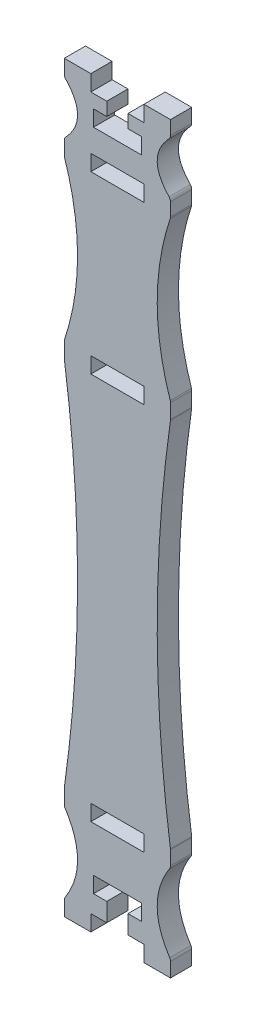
ISO-10303-21;
HEADER;
FILE_DESCRIPTION(('STEP AP214'),'2;1');
FILE_NAME('part.step','',(''),(''),'','','');
FILE_SCHEMA(('AUTOMOTIVE_DESIGN { 1 0 10303 214 1 1 1 1 }'));
ENDSEC;
DATA;
#1=APPLICATION_CONTEXT('core data for automotive mechanical design processes');
#2=APPLICATION_PROTOCOL_DEFINITION('international standard','automotive_design',2000,#1);
#3=PRODUCT_CONTEXT('',#1,'mechanical');
#4=PRODUCT('Part','Part','',(#3));
#5=PRODUCT_RELATED_PRODUCT_CATEGORY('part','',(#4));
#6=PRODUCT_DEFINITION_FORMATION('','',#4);
#7=PRODUCT_DEFINITION_CONTEXT('part definition',#1,'design');
#8=PRODUCT_DEFINITION('design','',#6,#7);
#9=PRODUCT_DEFINITION_SHAPE('','',#8);
#10=(LENGTH_UNIT() NAMED_UNIT(*) SI_UNIT(.MILLI.,.METRE.));
#11=(NAMED_UNIT(*) PLANE_ANGLE_UNIT() SI_UNIT($,.RADIAN.));
#12=(NAMED_UNIT(*) SI_UNIT($,.STERADIAN.) SOLID_ANGLE_UNIT());
#13=UNCERTAINTY_MEASURE_WITH_UNIT(LENGTH_MEASURE(1.E-05),#10,'distance_accuracy_value','');
#14=(GEOMETRIC_REPRESENTATION_CONTEXT(3) GLOBAL_UNCERTAINTY_ASSIGNED_CONTEXT((#13)) GLOBAL_UNIT_ASSIGNED_CONTEXT((#10,
#11,#12)) REPRESENTATION_CONTEXT('',''));
#15=CARTESIAN_POINT('',(0.,0.,0.));
#16=DIRECTION('',(0.,0.,1.));
#17=DIRECTION('',(1.,0.,0.));
#18=AXIS2_PLACEMENT_3D('',#15,#16,#17);
#19=CARTESIAN_POINT('',(3.99999999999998,56.5942523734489,4.));
#20=DIRECTION('',(0.,0.,-1.));
#21=DIRECTION('',(-1.,0.,0.));
#22=AXIS2_PLACEMENT_3D('',#19,#20,#21);
#23=CYLINDRICAL_SURFACE('',#22,1.);
#24=CARTESIAN_POINT('',(3.99999999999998,56.5942523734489,0.));
#25=DIRECTION('',(0.,0.,1.));
#26=DIRECTION('',(1.,0.,0.));
#27=AXIS2_PLACEMENT_3D('',#24,#25,#26);
#28=CIRCLE('',#27,1.);
#29=CARTESIAN_POINT('',(4.72722199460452,57.280654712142,0.));
#30=VERTEX_POINT('',#29);
#31=CARTESIAN_POINT('',(4.99999999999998,56.5942523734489,0.));
#32=VERTEX_POINT('',#31);
#33=EDGE_CURVE('E559',#30,#32,#28,.F.);
#34=ORIENTED_EDGE('',*,*,#33,.F.);
#35=DIRECTION('',(0.,0.,-1.));
#36=VECTOR('',#35,1.);
#37=CARTESIAN_POINT('',(4.72722199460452,57.280654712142,4.));
#38=LINE('',#37,#36);
#39=CARTESIAN_POINT('',(4.72722199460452,57.280654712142,4.));
#40=VERTEX_POINT('',#39);
#41=EDGE_CURVE('E11',#40,#30,#38,.T.);
#42=ORIENTED_EDGE('',*,*,#41,.F.);
#43=CARTESIAN_POINT('',(3.99999999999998,56.5942523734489,4.));
#44=DIRECTION('',(0.,0.,1.));
#45=DIRECTION('',(1.,0.,0.));
#46=AXIS2_PLACEMENT_3D('',#43,#44,#45);
#47=CIRCLE('',#46,1.);
#48=CARTESIAN_POINT('',(4.99999999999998,56.5942523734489,4.));
#49=VERTEX_POINT('',#48);
#50=EDGE_CURVE('E979',#40,#49,#47,.F.);
#51=ORIENTED_EDGE('',*,*,#50,.T.);
#52=DIRECTION('',(0.,0.,-1.));
#53=VECTOR('',#52,1.);
#54=CARTESIAN_POINT('',(4.99999999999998,56.5942523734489,4.));
#55=LINE('',#54,#53);
#56=EDGE_CURVE('E56',#49,#32,#55,.T.);
#57=ORIENTED_EDGE('',*,*,#56,.T.);
#58=EDGE_LOOP('',(#34,#42,#51,#57));
#59=FACE_BOUND('',#58,.T.);
#60=ADVANCED_FACE('F37',(#59),#23,.T.);
#61=CARTESIAN_POINT('',(4.72722199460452,57.280654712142,4.));
#62=CARTESIAN_POINT('',(3.2424073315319,58.8537698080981,4.));
#63=CARTESIAN_POINT('',(1.75759266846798,62.0000000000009,4.));
#64=CARTESIAN_POINT('',(3.2424073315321,65.1462301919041,4.));
#65=CARTESIAN_POINT('',(4.72722199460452,66.71934528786,4.));
#66=B_SPLINE_CURVE_WITH_KNOTS('',3,(#61,#62,#63,#64,#65),.UNSPECIFIED.,.F.,.F.,(4,1,4),
(0.0280654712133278,0.499999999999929,0.97193452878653),.UNSPECIFIED.);
#67=DIRECTION('',(0.,0.,-1.));
#68=VECTOR('',#67,1.);
#69=SURFACE_OF_LINEAR_EXTRUSION('',#66,#68);
#70=CARTESIAN_POINT('',(4.72722199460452,57.280654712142,0.));
#71=CARTESIAN_POINT('',(3.2424073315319,58.8537698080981,0.));
#72=CARTESIAN_POINT('',(1.75759266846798,62.0000000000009,0.));
#73=CARTESIAN_POINT('',(3.2424073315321,65.1462301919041,0.));
#74=CARTESIAN_POINT('',(4.72722199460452,66.71934528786,0.));
#75=B_SPLINE_CURVE_WITH_KNOTS('',3,(#70,#71,#72,#73,#74),.UNSPECIFIED.,.F.,.F.,(4,1,4),
(0.0280654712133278,0.499999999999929,0.97193452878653),.UNSPECIFIED.);
#76=CARTESIAN_POINT('',(4.72722199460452,66.71934528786,0.));
#77=VERTEX_POINT('',#76);
#78=EDGE_CURVE('E561',#30,#77,#75,.T.);
#79=ORIENTED_EDGE('',*,*,#78,.T.);
#80=DIRECTION('',(0.,0.,-1.));
#81=VECTOR('',#80,1.);
#82=CARTESIAN_POINT('',(4.72722199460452,66.71934528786,4.));
#83=LINE('',#82,#81);
#84=CARTESIAN_POINT('',(4.72722199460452,66.71934528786,4.));
#85=VERTEX_POINT('',#84);
#86=EDGE_CURVE('E47',#85,#77,#83,.T.);
#87=ORIENTED_EDGE('',*,*,#86,.F.);
#88=EDGE_CURVE('E981',#40,#85,#66,.T.);
#89=ORIENTED_EDGE('',*,*,#88,.F.);
#90=ORIENTED_EDGE('',*,*,#41,.T.);
#91=EDGE_LOOP('',(#79,#87,#89,#90));
#92=FACE_BOUND('',#91,.T.);
#93=ADVANCED_FACE('F993',(#92),#69,.F.);
#94=CARTESIAN_POINT('',(3.99999999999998,67.4057476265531,4.));
#95=DIRECTION('',(0.,0.,-1.));
#96=DIRECTION('',(-1.,0.,0.));
#97=AXIS2_PLACEMENT_3D('',#94,#95,#96);
#98=CYLINDRICAL_SURFACE('',#97,1.);
#99=CARTESIAN_POINT('',(3.99999999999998,67.4057476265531,0.));
#100=DIRECTION('',(0.,0.,1.));
#101=DIRECTION('',(1.,0.,0.));
#102=AXIS2_PLACEMENT_3D('',#99,#100,#101);
#103=CIRCLE('',#102,1.);
#104=CARTESIAN_POINT('',(4.99999999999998,67.4057476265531,0.));
#105=VERTEX_POINT('',#104);
#106=EDGE_CURVE('E566',#77,#105,#103,.T.);
#107=ORIENTED_EDGE('',*,*,#106,.T.);
#108=DIRECTION('',(0.,0.,-1.));
#109=VECTOR('',#108,1.);
#110=CARTESIAN_POINT('',(4.99999999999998,67.4057476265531,4.));
#111=LINE('',#110,#109);
#112=CARTESIAN_POINT('',(4.99999999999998,67.4057476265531,4.));
#113=VERTEX_POINT('',#112);
#114=EDGE_CURVE('E904',#113,#105,#111,.T.);
#115=ORIENTED_EDGE('',*,*,#114,.F.);
#116=CARTESIAN_POINT('',(3.99999999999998,67.4057476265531,4.));
#117=DIRECTION('',(0.,0.,1.));
#118=DIRECTION('',(1.,0.,0.));
#119=AXIS2_PLACEMENT_3D('',#116,#117,#118);
#120=CIRCLE('',#119,1.);
#121=EDGE_CURVE('E987',#85,#113,#120,.T.);
#122=ORIENTED_EDGE('',*,*,#121,.F.);
#123=ORIENTED_EDGE('',*,*,#86,.T.);
#124=EDGE_LOOP('',(#107,#115,#122,#123));
#125=FACE_BOUND('',#124,.T.);
#126=ADVANCED_FACE('F997',(#125),#98,.T.);
#127=CARTESIAN_POINT('',(4.99999999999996,0.,4.));
#128=DIRECTION('',(-1.,0.,0.));
#129=DIRECTION('',(0.,-1.,0.));
#130=AXIS2_PLACEMENT_3D('',#127,#128,#129);
#131=PLANE('',#130);
#132=DIRECTION('',(0.,1.,0.));
#133=VECTOR('',#132,1.);
#134=CARTESIAN_POINT('',(4.99999999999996,0.,0.));
#135=LINE('',#134,#133);
#136=CARTESIAN_POINT('',(4.99999999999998,70.0000000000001,0.));
#137=VERTEX_POINT('',#136);
#138=EDGE_CURVE('E572',#105,#137,#135,.T.);
#139=ORIENTED_EDGE('',*,*,#138,.T.);
#140=DIRECTION('',(0.,0.,-1.));
#141=VECTOR('',#140,1.);
#142=CARTESIAN_POINT('',(4.99999999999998,70.0000000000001,4.));
#143=LINE('',#142,#141);
#144=CARTESIAN_POINT('',(4.99999999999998,70.0000000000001,4.));
#145=VERTEX_POINT('',#144);
#146=EDGE_CURVE('E901',#145,#137,#143,.T.);
#147=ORIENTED_EDGE('',*,*,#146,.F.);
#148=DIRECTION('',(0.,1.,0.));
#149=VECTOR('',#148,1.);
#150=CARTESIAN_POINT('',(4.99999999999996,0.,4.));
#151=LINE('',#150,#149);
#152=EDGE_CURVE('E1767',#113,#145,#151,.T.);
#153=ORIENTED_EDGE('',*,*,#152,.F.);
#154=ORIENTED_EDGE('',*,*,#114,.T.);
#155=EDGE_LOOP('',(#139,#147,#153,#154));
#156=FACE_BOUND('',#155,.T.);
#157=ADVANCED_FACE('F1503',(#156),#131,.F.);
#158=CARTESIAN_POINT('',(0.,70.0000000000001,4.));
#159=DIRECTION('',(0.,-1.,0.));
#160=DIRECTION('',(0.,0.,-1.));
#161=AXIS2_PLACEMENT_3D('',#158,#159,#160);
#162=PLANE('',#161);
#163=DIRECTION('',(-1.,0.,0.));
#164=VECTOR('',#163,1.);
#165=CARTESIAN_POINT('',(0.,70.0000000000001,0.));
#166=LINE('',#165,#164);
#167=CARTESIAN_POINT('',(0.,70.0000000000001,0.));
#168=VERTEX_POINT('',#167);
#169=EDGE_CURVE('E575',#137,#168,#166,.T.);
#170=ORIENTED_EDGE('',*,*,#169,.T.);
#171=DIRECTION('',(0.,0.,-1.));
#172=VECTOR('',#171,1.);
#173=CARTESIAN_POINT('',(0.,70.0000000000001,4.));
#174=LINE('',#173,#172);
#175=CARTESIAN_POINT('',(0.,70.0000000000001,4.));
#176=VERTEX_POINT('',#175);
#177=EDGE_CURVE('E899',#176,#168,#174,.T.);
#178=ORIENTED_EDGE('',*,*,#177,.F.);
#179=DIRECTION('',(-1.,0.,0.));
#180=VECTOR('',#179,1.);
#181=CARTESIAN_POINT('',(0.,70.0000000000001,4.));
#182=LINE('',#181,#180);
#183=EDGE_CURVE('E1769',#145,#176,#182,.T.);
#184=ORIENTED_EDGE('',*,*,#183,.F.);
#185=ORIENTED_EDGE('',*,*,#146,.T.);
#186=EDGE_LOOP('',(#170,#178,#184,#185));
#187=FACE_BOUND('',#186,.T.);
#188=ADVANCED_FACE('F1495',(#187),#162,.F.);
#189=CARTESIAN_POINT('',(0.,0.,4.));
#190=DIRECTION('',(-1.,0.,0.));
#191=DIRECTION('',(0.,-1.,0.));
#192=AXIS2_PLACEMENT_3D('',#189,#190,#191);
#193=PLANE('',#192);
#194=DIRECTION('',(0.,1.,0.));
#195=VECTOR('',#194,1.);
#196=CARTESIAN_POINT('',(0.,0.,0.));
#197=LINE('',#196,#195);
#198=CARTESIAN_POINT('',(0.,67.0000000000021,0.));
#199=VERTEX_POINT('',#198);
#200=EDGE_CURVE('E578',#199,#168,#197,.T.);
#201=ORIENTED_EDGE('',*,*,#200,.F.);
#202=DIRECTION('',(0.,0.,-1.));
#203=VECTOR('',#202,1.);
#204=CARTESIAN_POINT('',(0.,67.0000000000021,4.));
#205=LINE('',#204,#203);
#206=CARTESIAN_POINT('',(0.,67.0000000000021,4.));
#207=VERTEX_POINT('',#206);
#208=EDGE_CURVE('E897',#207,#199,#205,.T.);
#209=ORIENTED_EDGE('',*,*,#208,.F.);
#210=DIRECTION('',(0.,1.,0.));
#211=VECTOR('',#210,1.);
#212=CARTESIAN_POINT('',(0.,0.,4.));
#213=LINE('',#212,#211);
#214=EDGE_CURVE('E1770',#207,#176,#213,.T.);
#215=ORIENTED_EDGE('',*,*,#214,.T.);
#216=ORIENTED_EDGE('',*,*,#177,.T.);
#217=EDGE_LOOP('',(#201,#209,#215,#216));
#218=FACE_BOUND('',#217,.T.);
#219=ADVANCED_FACE('F1487',(#218),#193,.T.);
#220=CARTESIAN_POINT('',(0.,67.0000000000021,4.));
#221=DIRECTION('',(0.,1.,0.));
#222=DIRECTION('',(0.,0.,1.));
#223=AXIS2_PLACEMENT_3D('',#220,#221,#222);
#224=PLANE('',#223);
#225=DIRECTION('',(1.,0.,0.));
#226=VECTOR('',#225,1.);
#227=CARTESIAN_POINT('',(0.,67.0000000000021,0.));
#228=LINE('',#227,#226);
#229=CARTESIAN_POINT('',(-2.99999999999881,67.0000000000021,0.));
#230=VERTEX_POINT('',#229);
#231=EDGE_CURVE('E581',#230,#199,#228,.T.);
#232=ORIENTED_EDGE('',*,*,#231,.F.);
#233=DIRECTION('',(0.,0.,-1.));
#234=VECTOR('',#233,1.);
#235=CARTESIAN_POINT('',(-2.99999999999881,67.0000000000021,4.));
#236=LINE('',#235,#234);
#237=CARTESIAN_POINT('',(-2.99999999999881,67.0000000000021,4.));
#238=VERTEX_POINT('',#237);
#239=EDGE_CURVE('E895',#238,#230,#236,.T.);
#240=ORIENTED_EDGE('',*,*,#239,.F.);
#241=DIRECTION('',(1.,0.,0.));
#242=VECTOR('',#241,1.);
#243=CARTESIAN_POINT('',(0.,67.0000000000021,4.));
#244=LINE('',#243,#242);
#245=EDGE_CURVE('E1775',#238,#207,#244,.T.);
#246=ORIENTED_EDGE('',*,*,#245,.T.);
#247=ORIENTED_EDGE('',*,*,#208,.T.);
#248=EDGE_LOOP('',(#232,#240,#246,#247));
#249=FACE_BOUND('',#248,.T.);
#250=ADVANCED_FACE('F1479',(#249),#224,.T.);
#251=CARTESIAN_POINT('',(-2.9999999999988,0.,4.));
#252=DIRECTION('',(-1.,0.,0.));
#253=DIRECTION('',(0.,-1.,0.));
#254=AXIS2_PLACEMENT_3D('',#251,#252,#253);
#255=PLANE('',#254);
#256=DIRECTION('',(0.,1.,0.));
#257=VECTOR('',#256,1.);
#258=CARTESIAN_POINT('',(-2.9999999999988,0.,0.));
#259=LINE('',#258,#257);
#260=CARTESIAN_POINT('',(-2.99999999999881,64.5000000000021,0.));
#261=VERTEX_POINT('',#260);
#262=EDGE_CURVE('E584',#261,#230,#259,.T.);
#263=ORIENTED_EDGE('',*,*,#262,.F.);
#264=DIRECTION('',(0.,0.,-1.));
#265=VECTOR('',#264,1.);
#266=CARTESIAN_POINT('',(-2.99999999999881,64.5000000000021,4.));
#267=LINE('',#266,#265);
#268=CARTESIAN_POINT('',(-2.99999999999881,64.5000000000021,4.));
#269=VERTEX_POINT('',#268);
#270=EDGE_CURVE('E893',#269,#261,#267,.T.);
#271=ORIENTED_EDGE('',*,*,#270,.F.);
#272=DIRECTION('',(0.,1.,0.));
#273=VECTOR('',#272,1.);
#274=CARTESIAN_POINT('',(-2.9999999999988,0.,4.));
#275=LINE('',#274,#273);
#276=EDGE_CURVE('E1778',#269,#238,#275,.T.);
#277=ORIENTED_EDGE('',*,*,#276,.T.);
#278=ORIENTED_EDGE('',*,*,#239,.T.);
#279=EDGE_LOOP('',(#263,#271,#277,#278));
#280=FACE_BOUND('',#279,.T.);
#281=ADVANCED_FACE('F1471',(#280),#255,.T.);
#282=CARTESIAN_POINT('',(0.,64.5000000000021,4.));
#283=DIRECTION('',(0.,-1.,0.));
#284=DIRECTION('',(0.,0.,-1.));
#285=AXIS2_PLACEMENT_3D('',#282,#283,#284);
#286=PLANE('',#285);
#287=DIRECTION('',(-1.,0.,0.));
#288=VECTOR('',#287,1.);
#289=CARTESIAN_POINT('',(0.,64.5000000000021,0.));
#290=LINE('',#289,#288);
#291=CARTESIAN_POINT('',(-0.499999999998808,64.5000000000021,0.));
#292=VERTEX_POINT('',#291);
#293=EDGE_CURVE('E587',#292,#261,#290,.T.);
#294=ORIENTED_EDGE('',*,*,#293,.F.);
#295=DIRECTION('',(0.,0.,-1.));
#296=VECTOR('',#295,1.);
#297=CARTESIAN_POINT('',(-0.499999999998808,64.5000000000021,4.));
#298=LINE('',#297,#296);
#299=CARTESIAN_POINT('',(-0.499999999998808,64.5000000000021,4.));
#300=VERTEX_POINT('',#299);
#301=EDGE_CURVE('E891',#300,#292,#298,.T.);
#302=ORIENTED_EDGE('',*,*,#301,.F.);
#303=DIRECTION('',(-1.,0.,0.));
#304=VECTOR('',#303,1.);
#305=CARTESIAN_POINT('',(0.,64.5000000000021,4.));
#306=LINE('',#305,#304);
#307=EDGE_CURVE('E1781',#300,#269,#306,.T.);
#308=ORIENTED_EDGE('',*,*,#307,.T.);
#309=ORIENTED_EDGE('',*,*,#270,.T.);
#310=EDGE_LOOP('',(#294,#302,#308,#309));
#311=FACE_BOUND('',#310,.T.);
#312=ADVANCED_FACE('F1463',(#311),#286,.T.);
#313=CARTESIAN_POINT('',(-0.499999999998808,0.,4.));
#314=DIRECTION('',(-1.,0.,0.));
#315=DIRECTION('',(0.,0.,1.));
#316=AXIS2_PLACEMENT_3D('',#313,#314,#315);
#317=PLANE('',#316);
#318=DIRECTION('',(0.,1.,0.));
#319=VECTOR('',#318,1.);
#320=CARTESIAN_POINT('',(-0.499999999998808,0.,0.));
#321=LINE('',#320,#319);
#322=CARTESIAN_POINT('',(-0.499999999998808,61.5000000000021,0.));
#323=VERTEX_POINT('',#322);
#324=EDGE_CURVE('E590',#323,#292,#321,.T.);
#325=ORIENTED_EDGE('',*,*,#324,.F.);
#326=DIRECTION('',(0.,0.,-1.));
#327=VECTOR('',#326,1.);
#328=CARTESIAN_POINT('',(-0.499999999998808,61.5000000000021,4.));
#329=LINE('',#328,#327);
#330=CARTESIAN_POINT('',(-0.499999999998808,61.5000000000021,4.));
#331=VERTEX_POINT('',#330);
#332=EDGE_CURVE('E889',#331,#323,#329,.T.);
#333=ORIENTED_EDGE('',*,*,#332,.F.);
#334=DIRECTION('',(0.,1.,0.));
#335=VECTOR('',#334,1.);
#336=CARTESIAN_POINT('',(-0.499999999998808,0.,4.));
#337=LINE('',#336,#335);
#338=EDGE_CURVE('E1784',#331,#300,#337,.T.);
#339=ORIENTED_EDGE('',*,*,#338,.T.);
#340=ORIENTED_EDGE('',*,*,#301,.T.);
#341=EDGE_LOOP('',(#325,#333,#339,#340));
#342=FACE_BOUND('',#341,.T.);
#343=ADVANCED_FACE('F1455',(#342),#317,.T.);
#344=CARTESIAN_POINT('',(0.,61.5000000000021,4.));
#345=DIRECTION('',(0.,1.,0.));
#346=DIRECTION('',(0.,0.,1.));
#347=AXIS2_PLACEMENT_3D('',#344,#345,#346);
#348=PLANE('',#347);
#349=DIRECTION('',(1.,0.,0.));
#350=VECTOR('',#349,1.);
#351=CARTESIAN_POINT('',(0.,61.5000000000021,0.));
#352=LINE('',#351,#350);
#353=CARTESIAN_POINT('',(-9.49999999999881,61.5000000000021,0.));
#354=VERTEX_POINT('',#353);
#355=EDGE_CURVE('E593',#354,#323,#352,.T.);
#356=ORIENTED_EDGE('',*,*,#355,.F.);
#357=DIRECTION('',(0.,0.,-1.));
#358=VECTOR('',#357,1.);
#359=CARTESIAN_POINT('',(-9.49999999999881,61.5000000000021,4.));
#360=LINE('',#359,#358);
#361=CARTESIAN_POINT('',(-9.49999999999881,61.5000000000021,4.));
#362=VERTEX_POINT('',#361);
#363=EDGE_CURVE('E887',#362,#354,#360,.T.);
#364=ORIENTED_EDGE('',*,*,#363,.F.);
#365=DIRECTION('',(1.,0.,0.));
#366=VECTOR('',#365,1.);
#367=CARTESIAN_POINT('',(0.,61.5000000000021,4.));
#368=LINE('',#367,#366);
#369=EDGE_CURVE('E1787',#362,#331,#368,.T.);
#370=ORIENTED_EDGE('',*,*,#369,.T.);
#371=ORIENTED_EDGE('',*,*,#332,.T.);
#372=EDGE_LOOP('',(#356,#364,#370,#371));
#373=FACE_BOUND('',#372,.T.);
#374=ADVANCED_FACE('F1447',(#373),#348,.T.);
#375=CARTESIAN_POINT('',(-9.49999999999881,0.,4.));
#376=DIRECTION('',(-1.,0.,0.));
#377=DIRECTION('',(0.,0.,1.));
#378=AXIS2_PLACEMENT_3D('',#375,#376,#377);
#379=PLANE('',#378);
#380=DIRECTION('',(0.,1.,0.));
#381=VECTOR('',#380,1.);
#382=CARTESIAN_POINT('',(-9.49999999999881,0.,0.));
#383=LINE('',#382,#381);
#384=CARTESIAN_POINT('',(-9.49999999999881,64.5000000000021,0.));
#385=VERTEX_POINT('',#384);
#386=EDGE_CURVE('E596',#354,#385,#383,.T.);
#387=ORIENTED_EDGE('',*,*,#386,.T.);
#388=DIRECTION('',(0.,0.,-1.));
#389=VECTOR('',#388,1.);
#390=CARTESIAN_POINT('',(-9.49999999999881,64.5000000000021,4.));
#391=LINE('',#390,#389);
#392=CARTESIAN_POINT('',(-9.49999999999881,64.5000000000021,4.));
#393=VERTEX_POINT('',#392);
#394=EDGE_CURVE('E884',#393,#385,#391,.T.);
#395=ORIENTED_EDGE('',*,*,#394,.F.);
#396=DIRECTION('',(0.,1.,0.));
#397=VECTOR('',#396,1.);
#398=CARTESIAN_POINT('',(-9.49999999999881,0.,4.));
#399=LINE('',#398,#397);
#400=EDGE_CURVE('E1790',#362,#393,#399,.T.);
#401=ORIENTED_EDGE('',*,*,#400,.F.);
#402=ORIENTED_EDGE('',*,*,#363,.T.);
#403=EDGE_LOOP('',(#387,#395,#401,#402));
#404=FACE_BOUND('',#403,.T.);
#405=ADVANCED_FACE('F1439',(#404),#379,.F.);
#406=CARTESIAN_POINT('',(0.,64.5000000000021,4.));
#407=DIRECTION('',(0.,1.,0.));
#408=DIRECTION('',(0.,0.,1.));
#409=AXIS2_PLACEMENT_3D('',#406,#407,#408);
#410=PLANE('',#409);
#411=DIRECTION('',(1.,0.,0.));
#412=VECTOR('',#411,1.);
#413=CARTESIAN_POINT('',(0.,64.5000000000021,0.));
#414=LINE('',#413,#412);
#415=CARTESIAN_POINT('',(-6.99999999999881,64.5000000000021,0.));
#416=VERTEX_POINT('',#415);
#417=EDGE_CURVE('E599',#385,#416,#414,.T.);
#418=ORIENTED_EDGE('',*,*,#417,.T.);
#419=DIRECTION('',(0.,0.,-1.));
#420=VECTOR('',#419,1.);
#421=CARTESIAN_POINT('',(-6.99999999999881,64.5000000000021,4.));
#422=LINE('',#421,#420);
#423=CARTESIAN_POINT('',(-6.99999999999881,64.5000000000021,4.));
#424=VERTEX_POINT('',#423);
#425=EDGE_CURVE('E881',#424,#416,#422,.T.);
#426=ORIENTED_EDGE('',*,*,#425,.F.);
#427=DIRECTION('',(1.,0.,0.));
#428=VECTOR('',#427,1.);
#429=CARTESIAN_POINT('',(0.,64.5000000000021,4.));
#430=LINE('',#429,#428);
#431=EDGE_CURVE('E1793',#393,#424,#430,.T.);
#432=ORIENTED_EDGE('',*,*,#431,.F.);
#433=ORIENTED_EDGE('',*,*,#394,.T.);
#434=EDGE_LOOP('',(#418,#426,#432,#433));
#435=FACE_BOUND('',#434,.T.);
#436=ADVANCED_FACE('F1431',(#435),#410,.F.);
#437=CARTESIAN_POINT('',(-6.99999999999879,0.,4.));
#438=DIRECTION('',(-1.,0.,0.));
#439=DIRECTION('',(0.,-1.,0.));
#440=AXIS2_PLACEMENT_3D('',#437,#438,#439);
#441=PLANE('',#440);
#442=DIRECTION('',(0.,1.,0.));
#443=VECTOR('',#442,1.);
#444=CARTESIAN_POINT('',(-6.99999999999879,0.,0.));
#445=LINE('',#444,#443);
#446=CARTESIAN_POINT('',(-6.99999999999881,67.0000000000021,0.));
#447=VERTEX_POINT('',#446);
#448=EDGE_CURVE('E602',#416,#447,#445,.T.);
#449=ORIENTED_EDGE('',*,*,#448,.T.);
#450=DIRECTION('',(0.,0.,-1.));
#451=VECTOR('',#450,1.);
#452=CARTESIAN_POINT('',(-6.99999999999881,67.0000000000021,4.));
#453=LINE('',#452,#451);
#454=CARTESIAN_POINT('',(-6.99999999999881,67.0000000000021,4.));
#455=VERTEX_POINT('',#454);
#456=EDGE_CURVE('E878',#455,#447,#453,.T.);
#457=ORIENTED_EDGE('',*,*,#456,.F.);
#458=DIRECTION('',(0.,1.,0.));
#459=VECTOR('',#458,1.);
#460=CARTESIAN_POINT('',(-6.99999999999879,0.,4.));
#461=LINE('',#460,#459);
#462=EDGE_CURVE('E1796',#424,#455,#461,.T.);
#463=ORIENTED_EDGE('',*,*,#462,.F.);
#464=ORIENTED_EDGE('',*,*,#425,.T.);
#465=EDGE_LOOP('',(#449,#457,#463,#464));
#466=FACE_BOUND('',#465,.T.);
#467=ADVANCED_FACE('F1423',(#466),#441,.F.);
#468=CARTESIAN_POINT('',(0.,67.0000000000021,4.));
#469=DIRECTION('',(0.,-1.,0.));
#470=DIRECTION('',(0.,0.,-1.));
#471=AXIS2_PLACEMENT_3D('',#468,#469,#470);
#472=PLANE('',#471);
#473=DIRECTION('',(-1.,0.,0.));
#474=VECTOR('',#473,1.);
#475=CARTESIAN_POINT('',(0.,67.0000000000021,0.));
#476=LINE('',#475,#474);
#477=CARTESIAN_POINT('',(-9.99999999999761,67.0000000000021,0.));
#478=VERTEX_POINT('',#477);
#479=EDGE_CURVE('E605',#447,#478,#476,.T.);
#480=ORIENTED_EDGE('',*,*,#479,.T.);
#481=DIRECTION('',(0.,0.,-1.));
#482=VECTOR('',#481,1.);
#483=CARTESIAN_POINT('',(-9.99999999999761,67.0000000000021,4.));
#484=LINE('',#483,#482);
#485=CARTESIAN_POINT('',(-9.99999999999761,67.0000000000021,4.));
#486=VERTEX_POINT('',#485);
#487=EDGE_CURVE('E876',#486,#478,#484,.T.);
#488=ORIENTED_EDGE('',*,*,#487,.F.);
#489=DIRECTION('',(-1.,0.,0.));
#490=VECTOR('',#489,1.);
#491=CARTESIAN_POINT('',(0.,67.0000000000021,4.));
#492=LINE('',#491,#490);
#493=EDGE_CURVE('E1799',#455,#486,#492,.T.);
#494=ORIENTED_EDGE('',*,*,#493,.F.);
#495=ORIENTED_EDGE('',*,*,#456,.T.);
#496=EDGE_LOOP('',(#480,#488,#494,#495));
#497=FACE_BOUND('',#496,.T.);
#498=ADVANCED_FACE('F1415',(#497),#472,.F.);
#499=CARTESIAN_POINT('',(-9.99999999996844,-4.35415592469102E-12,4.));
#500=DIRECTION('',(1.,4.35415592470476E-13,0.));
#501=DIRECTION('',(-4.35415592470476E-13,1.,0.));
#502=AXIS2_PLACEMENT_3D('',#499,#500,#501);
#503=PLANE('',#502);
#504=DIRECTION('',(4.35415592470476E-13,-1.,0.));
#505=VECTOR('',#504,1.);
#506=CARTESIAN_POINT('',(-9.99999999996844,-4.35415592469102E-12,0.));
#507=LINE('',#506,#505);
#508=CARTESIAN_POINT('',(-9.99999999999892,70.0000000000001,0.));
#509=VERTEX_POINT('',#508);
#510=EDGE_CURVE('E608',#509,#478,#507,.T.);
#511=ORIENTED_EDGE('',*,*,#510,.F.);
#512=DIRECTION('',(0.,0.,-1.));
#513=VECTOR('',#512,1.);
#514=CARTESIAN_POINT('',(-9.99999999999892,70.0000000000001,4.));
#515=LINE('',#514,#513);
#516=CARTESIAN_POINT('',(-9.99999999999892,70.0000000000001,4.));
#517=VERTEX_POINT('',#516);
#518=EDGE_CURVE('E874',#517,#509,#515,.T.);
#519=ORIENTED_EDGE('',*,*,#518,.F.);
#520=DIRECTION('',(4.35415592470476E-13,-1.,0.));
#521=VECTOR('',#520,1.);
#522=CARTESIAN_POINT('',(-9.99999999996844,-4.35415592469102E-12,4.));
#523=LINE('',#522,#521);
#524=EDGE_CURVE('E1801',#517,#486,#523,.T.);
#525=ORIENTED_EDGE('',*,*,#524,.T.);
#526=ORIENTED_EDGE('',*,*,#487,.T.);
#527=EDGE_LOOP('',(#511,#519,#525,#526));
#528=FACE_BOUND('',#527,.T.);
#529=ADVANCED_FACE('F1407',(#528),#503,.T.);
#530=CARTESIAN_POINT('',(0.,70.0000000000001,4.));
#531=DIRECTION('',(0.,-1.,0.));
#532=DIRECTION('',(0.,0.,-1.));
#533=AXIS2_PLACEMENT_3D('',#530,#531,#532);
#534=PLANE('',#533);
#535=DIRECTION('',(-1.,0.,0.));
#536=VECTOR('',#535,1.);
#537=CARTESIAN_POINT('',(0.,70.0000000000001,0.));
#538=LINE('',#537,#536);
#539=CARTESIAN_POINT('',(-15.,70.0000000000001,0.));
#540=VERTEX_POINT('',#539);
#541=EDGE_CURVE('E611',#509,#540,#538,.T.);
#542=ORIENTED_EDGE('',*,*,#541,.T.);
#543=DIRECTION('',(0.,0.,-1.));
#544=VECTOR('',#543,1.);
#545=CARTESIAN_POINT('',(-15.,70.0000000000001,4.));
#546=LINE('',#545,#544);
#547=CARTESIAN_POINT('',(-15.,70.0000000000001,4.));
#548=VERTEX_POINT('',#547);
#549=EDGE_CURVE('E872',#548,#540,#546,.T.);
#550=ORIENTED_EDGE('',*,*,#549,.F.);
#551=DIRECTION('',(-1.,0.,0.));
#552=VECTOR('',#551,1.);
#553=CARTESIAN_POINT('',(0.,70.0000000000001,4.));
#554=LINE('',#553,#552);
#555=EDGE_CURVE('E1804',#517,#548,#554,.T.);
#556=ORIENTED_EDGE('',*,*,#555,.F.);
#557=ORIENTED_EDGE('',*,*,#518,.T.);
#558=EDGE_LOOP('',(#542,#550,#556,#557));
#559=FACE_BOUND('',#558,.T.);
#560=ADVANCED_FACE('F1399',(#559),#534,.F.);
#561=CARTESIAN_POINT('',(-15.,0.,4.));
#562=DIRECTION('',(-1.,0.,0.));
#563=DIRECTION('',(0.,0.,1.));
#564=AXIS2_PLACEMENT_3D('',#561,#562,#563);
#565=PLANE('',#564);
#566=DIRECTION('',(0.,1.,0.));
#567=VECTOR('',#566,1.);
#568=CARTESIAN_POINT('',(-15.,0.,0.));
#569=LINE('',#568,#567);
#570=CARTESIAN_POINT('',(-15.,67.4057476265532,0.));
#571=VERTEX_POINT('',#570);
#572=EDGE_CURVE('E614',#571,#540,#569,.T.);
#573=ORIENTED_EDGE('',*,*,#572,.F.);
#574=DIRECTION('',(0.,0.,-1.));
#575=VECTOR('',#574,1.);
#576=CARTESIAN_POINT('',(-15.,67.4057476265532,4.));
#577=LINE('',#576,#575);
#578=CARTESIAN_POINT('',(-15.,67.4057476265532,4.));
#579=VERTEX_POINT('',#578);
#580=EDGE_CURVE('E870',#579,#571,#577,.T.);
#581=ORIENTED_EDGE('',*,*,#580,.F.);
#582=DIRECTION('',(0.,1.,0.));
#583=VECTOR('',#582,1.);
#584=CARTESIAN_POINT('',(-15.,0.,4.));
#585=LINE('',#584,#583);
#586=EDGE_CURVE('E1806',#579,#548,#585,.T.);
#587=ORIENTED_EDGE('',*,*,#586,.T.);
#588=ORIENTED_EDGE('',*,*,#549,.T.);
#589=EDGE_LOOP('',(#573,#581,#587,#588));
#590=FACE_BOUND('',#589,.T.);
#591=ADVANCED_FACE('F1391',(#590),#565,.T.);
#592=CARTESIAN_POINT('',(-14.,67.4057476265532,4.));
#593=DIRECTION('',(0.,0.,-1.));
#594=DIRECTION('',(-1.,0.,0.));
#595=AXIS2_PLACEMENT_3D('',#592,#593,#594);
#596=CYLINDRICAL_SURFACE('',#595,1.);
#597=CARTESIAN_POINT('',(-14.,67.4057476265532,0.));
#598=DIRECTION('',(0.,0.,1.));
#599=DIRECTION('',(1.,0.,0.));
#600=AXIS2_PLACEMENT_3D('',#597,#598,#599);
#601=CIRCLE('',#600,1.);
#602=CARTESIAN_POINT('',(-14.7272219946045,66.71934528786,0.));
#603=VERTEX_POINT('',#602);
#604=EDGE_CURVE('E617',#603,#571,#601,.F.);
#605=ORIENTED_EDGE('',*,*,#604,.F.);
#606=DIRECTION('',(0.,0.,-1.));
#607=VECTOR('',#606,1.);
#608=CARTESIAN_POINT('',(-14.7272219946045,66.71934528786,4.));
#609=LINE('',#608,#607);
#610=CARTESIAN_POINT('',(-14.7272219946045,66.71934528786,4.));
#611=VERTEX_POINT('',#610);
#612=EDGE_CURVE('E868',#611,#603,#609,.T.);
#613=ORIENTED_EDGE('',*,*,#612,.F.);
#614=CARTESIAN_POINT('',(-14.,67.4057476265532,4.));
#615=DIRECTION('',(0.,0.,1.));
#616=DIRECTION('',(1.,0.,0.));
#617=AXIS2_PLACEMENT_3D('',#614,#615,#616);
#618=CIRCLE('',#617,1.);
#619=EDGE_CURVE('E1809',#611,#579,#618,.F.);
#620=ORIENTED_EDGE('',*,*,#619,.T.);
#621=ORIENTED_EDGE('',*,*,#580,.T.);
#622=EDGE_LOOP('',(#605,#613,#620,#621));
#623=FACE_BOUND('',#622,.T.);
#624=ADVANCED_FACE('F1383',(#623),#596,.T.);
#625=CARTESIAN_POINT('',(-14.7272219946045,57.280654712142,4.));
#626=CARTESIAN_POINT('',(-13.2424073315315,58.8537698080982,4.));
#627=CARTESIAN_POINT('',(-11.7575926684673,62.0000000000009,4.));
#628=CARTESIAN_POINT('',(-13.2424073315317,65.1462301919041,4.));
#629=CARTESIAN_POINT('',(-14.7272219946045,66.71934528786,4.));
#630=B_SPLINE_CURVE_WITH_KNOTS('',3,(#625,#626,#627,#628,#629),.UNSPECIFIED.,.F.,.F.,(4,1,4),
(0.0280654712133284,0.49999999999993,0.97193452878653),.UNSPECIFIED.);
#631=DIRECTION('',(0.,0.,-1.));
#632=VECTOR('',#631,1.);
#633=SURFACE_OF_LINEAR_EXTRUSION('',#630,#632);
#634=CARTESIAN_POINT('',(-14.7272219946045,57.280654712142,0.));
#635=CARTESIAN_POINT('',(-13.2424073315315,58.8537698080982,0.));
#636=CARTESIAN_POINT('',(-11.7575926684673,62.0000000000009,0.));
#637=CARTESIAN_POINT('',(-13.2424073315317,65.1462301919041,0.));
#638=CARTESIAN_POINT('',(-14.7272219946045,66.71934528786,0.));
#639=B_SPLINE_CURVE_WITH_KNOTS('',3,(#634,#635,#636,#637,#638),.UNSPECIFIED.,.F.,.F.,(4,1,4),
(0.0280654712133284,0.49999999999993,0.97193452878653),.UNSPECIFIED.);
#640=CARTESIAN_POINT('',(-14.7272219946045,57.280654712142,0.));
#641=VERTEX_POINT('',#640);
#642=EDGE_CURVE('E620',#641,#603,#639,.T.);
#643=ORIENTED_EDGE('',*,*,#642,.F.);
#644=DIRECTION('',(0.,0.,-1.));
#645=VECTOR('',#644,1.);
#646=CARTESIAN_POINT('',(-14.7272219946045,57.280654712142,4.));
#647=LINE('',#646,#645);
#648=CARTESIAN_POINT('',(-14.7272219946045,57.280654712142,4.));
#649=VERTEX_POINT('',#648);
#650=EDGE_CURVE('E866',#649,#641,#647,.T.);
#651=ORIENTED_EDGE('',*,*,#650,.F.);
#652=EDGE_CURVE('E1812',#649,#611,#630,.T.);
#653=ORIENTED_EDGE('',*,*,#652,.T.);
#654=ORIENTED_EDGE('',*,*,#612,.T.);
#655=EDGE_LOOP('',(#643,#651,#653,#654));
#656=FACE_BOUND('',#655,.T.);
#657=ADVANCED_FACE('F1375',(#656),#633,.T.);
#658=CARTESIAN_POINT('',(-14.,56.5942523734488,4.));
#659=DIRECTION('',(0.,0.,-1.));
#660=DIRECTION('',(-1.,0.,0.));
#661=AXIS2_PLACEMENT_3D('',#658,#659,#660);
#662=CYLINDRICAL_SURFACE('',#661,1.);
#663=CARTESIAN_POINT('',(-14.,56.5942523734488,0.));
#664=DIRECTION('',(0.,0.,1.));
#665=DIRECTION('',(1.,0.,0.));
#666=AXIS2_PLACEMENT_3D('',#663,#664,#665);
#667=CIRCLE('',#666,1.);
#668=CARTESIAN_POINT('',(-15.,56.5942523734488,0.));
#669=VERTEX_POINT('',#668);
#670=EDGE_CURVE('E625',#669,#641,#667,.F.);
#671=ORIENTED_EDGE('',*,*,#670,.F.);
#672=DIRECTION('',(0.,0.,-1.));
#673=VECTOR('',#672,1.);
#674=CARTESIAN_POINT('',(-15.,56.5942523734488,4.));
#675=LINE('',#674,#673);
#676=CARTESIAN_POINT('',(-15.,56.5942523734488,4.));
#677=VERTEX_POINT('',#676);
#678=EDGE_CURVE('E864',#677,#669,#675,.T.);
#679=ORIENTED_EDGE('',*,*,#678,.F.);
#680=CARTESIAN_POINT('',(-14.,56.5942523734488,4.));
#681=DIRECTION('',(0.,0.,1.));
#682=DIRECTION('',(1.,0.,0.));
#683=AXIS2_PLACEMENT_3D('',#680,#681,#682);
#684=CIRCLE('',#683,1.);
#685=EDGE_CURVE('E1818',#677,#649,#684,.F.);
#686=ORIENTED_EDGE('',*,*,#685,.T.);
#687=ORIENTED_EDGE('',*,*,#650,.T.);
#688=EDGE_LOOP('',(#671,#679,#686,#687));
#689=FACE_BOUND('',#688,.T.);
#690=ADVANCED_FACE('F1367',(#689),#662,.T.);
#691=CARTESIAN_POINT('',(-15.,0.,4.));
#692=DIRECTION('',(-1.,0.,0.));
#693=DIRECTION('',(0.,0.,1.));
#694=AXIS2_PLACEMENT_3D('',#691,#692,#693);
#695=PLANE('',#694);
#696=DIRECTION('',(0.,1.,0.));
#697=VECTOR('',#696,1.);
#698=CARTESIAN_POINT('',(-15.,0.,0.));
#699=LINE('',#698,#697);
#700=CARTESIAN_POINT('',(-15.,54.1614944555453,0.));
#701=VERTEX_POINT('',#700);
#702=EDGE_CURVE('E631',#701,#669,#699,.T.);
#703=ORIENTED_EDGE('',*,*,#702,.F.);
#704=DIRECTION('',(0.,0.,-1.));
#705=VECTOR('',#704,1.);
#706=CARTESIAN_POINT('',(-15.,54.1614944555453,4.));
#707=LINE('',#706,#705);
#708=CARTESIAN_POINT('',(-15.,54.1614944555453,4.));
#709=VERTEX_POINT('',#708);
#710=EDGE_CURVE('E862',#709,#701,#707,.T.);
#711=ORIENTED_EDGE('',*,*,#710,.F.);
#712=DIRECTION('',(0.,1.,0.));
#713=VECTOR('',#712,1.);
#714=CARTESIAN_POINT('',(-15.,0.,4.));
#715=LINE('',#714,#713);
#716=EDGE_CURVE('E2026',#709,#677,#715,.T.);
#717=ORIENTED_EDGE('',*,*,#716,.T.);
#718=ORIENTED_EDGE('',*,*,#678,.T.);
#719=EDGE_LOOP('',(#703,#711,#717,#718));
#720=FACE_BOUND('',#719,.T.);
#721=ADVANCED_FACE('F1359',(#720),#695,.T.);
#722=CARTESIAN_POINT('',(-14.,54.1614944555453,4.));
#723=DIRECTION('',(0.,0.,-1.));
#724=DIRECTION('',(-1.,0.,0.));
#725=AXIS2_PLACEMENT_3D('',#722,#723,#724);
#726=CYLINDRICAL_SURFACE('',#725,0.999999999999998);
#727=CARTESIAN_POINT('',(-14.,54.1614944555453,0.));
#728=DIRECTION('',(0.,0.,1.));
#729=DIRECTION('',(1.,0.,0.));
#730=AXIS2_PLACEMENT_3D('',#727,#728,#729);
#731=CIRCLE('',#730,0.999999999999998);
#732=CARTESIAN_POINT('',(-14.9496402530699,53.8481521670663,0.));
#733=VERTEX_POINT('',#732);
#734=EDGE_CURVE('E634',#733,#701,#731,.F.);
#735=ORIENTED_EDGE('',*,*,#734,.F.);
#736=DIRECTION('',(0.,0.,-1.));
#737=VECTOR('',#736,1.);
#738=CARTESIAN_POINT('',(-14.9496402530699,53.8481521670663,4.));
#739=LINE('',#738,#737);
#740=CARTESIAN_POINT('',(-14.9496402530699,53.8481521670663,4.));
#741=VERTEX_POINT('',#740);
#742=EDGE_CURVE('E860',#741,#733,#739,.T.);
#743=ORIENTED_EDGE('',*,*,#742,.F.);
#744=CARTESIAN_POINT('',(-14.,54.1614944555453,4.));
#745=DIRECTION('',(0.,0.,1.));
#746=DIRECTION('',(1.,0.,0.));
#747=AXIS2_PLACEMENT_3D('',#744,#745,#746);
#748=CIRCLE('',#747,0.999999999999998);
#749=EDGE_CURVE('E1832',#741,#709,#748,.F.);
#750=ORIENTED_EDGE('',*,*,#749,.T.);
#751=ORIENTED_EDGE('',*,*,#710,.T.);
#752=EDGE_LOOP('',(#735,#743,#750,#751));
#753=FACE_BOUND('',#752,.T.);
#754=ADVANCED_FACE('F1351',(#753),#726,.T.);
#755=CARTESIAN_POINT('',(-14.9496402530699,24.1518478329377,4.));
#756=CARTESIAN_POINT('',(-13.3165467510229,29.1012318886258,4.));
#757=CARTESIAN_POINT('',(-11.683453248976,39.000000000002,4.));
#758=CARTESIAN_POINT('',(-13.316546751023,48.8987681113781,4.));
#759=CARTESIAN_POINT('',(-14.9496402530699,53.8481521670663,4.));
#760=B_SPLINE_CURVE_WITH_KNOTS('',3,(#755,#756,#757,#758,#759),.UNSPECIFIED.,.F.,.F.,(4,1,4),
(0.00506159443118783,0.5,0.994938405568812),.UNSPECIFIED.);
#761=DIRECTION('',(0.,0.,-1.));
#762=VECTOR('',#761,1.);
#763=SURFACE_OF_LINEAR_EXTRUSION('',#760,#762);
#764=CARTESIAN_POINT('',(-14.9496402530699,24.1518478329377,0.));
#765=CARTESIAN_POINT('',(-13.3165467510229,29.1012318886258,0.));
#766=CARTESIAN_POINT('',(-11.683453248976,39.000000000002,0.));
#767=CARTESIAN_POINT('',(-13.316546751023,48.8987681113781,0.));
#768=CARTESIAN_POINT('',(-14.9496402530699,53.8481521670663,0.));
#769=B_SPLINE_CURVE_WITH_KNOTS('',3,(#764,#765,#766,#767,#768),.UNSPECIFIED.,.F.,.F.,(4,1,4),
(0.00506159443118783,0.5,0.994938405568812),.UNSPECIFIED.);
#770=CARTESIAN_POINT('',(-14.9496402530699,24.1518478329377,0.));
#771=VERTEX_POINT('',#770);
#772=EDGE_CURVE('E637',#771,#733,#769,.T.);
#773=ORIENTED_EDGE('',*,*,#772,.F.);
#774=DIRECTION('',(0.,0.,-1.));
#775=VECTOR('',#774,1.);
#776=CARTESIAN_POINT('',(-14.9496402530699,24.1518478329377,4.));
#777=LINE('',#776,#775);
#778=CARTESIAN_POINT('',(-14.9496402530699,24.1518478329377,4.));
#779=VERTEX_POINT('',#778);
#780=EDGE_CURVE('E858',#779,#771,#777,.T.);
#781=ORIENTED_EDGE('',*,*,#780,.F.);
#782=EDGE_CURVE('E1824',#779,#741,#760,.T.);
#783=ORIENTED_EDGE('',*,*,#782,.T.);
#784=ORIENTED_EDGE('',*,*,#742,.T.);
#785=EDGE_LOOP('',(#773,#781,#783,#784));
#786=FACE_BOUND('',#785,.T.);
#787=ADVANCED_FACE('F1343',(#786),#763,.T.);
#788=CARTESIAN_POINT('',(-14.,23.8385055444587,4.));
#789=DIRECTION('',(0.,0.,-1.));
#790=DIRECTION('',(-1.,0.,0.));
#791=AXIS2_PLACEMENT_3D('',#788,#789,#790);
#792=CYLINDRICAL_SURFACE('',#791,1.);
#793=CARTESIAN_POINT('',(-14.,23.8385055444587,0.));
#794=DIRECTION('',(0.,0.,1.));
#795=DIRECTION('',(1.,0.,0.));
#796=AXIS2_PLACEMENT_3D('',#793,#794,#795);
#797=CIRCLE('',#796,1.);
#798=CARTESIAN_POINT('',(-15.,23.8385055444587,0.));
#799=VERTEX_POINT('',#798);
#800=EDGE_CURVE('E642',#799,#771,#797,.F.);
#801=ORIENTED_EDGE('',*,*,#800,.F.);
#802=DIRECTION('',(0.,0.,-1.));
#803=VECTOR('',#802,1.);
#804=CARTESIAN_POINT('',(-15.,23.8385055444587,4.));
#805=LINE('',#804,#803);
#806=CARTESIAN_POINT('',(-15.,23.8385055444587,4.));
#807=VERTEX_POINT('',#806);
#808=EDGE_CURVE('E856',#807,#799,#805,.T.);
#809=ORIENTED_EDGE('',*,*,#808,.F.);
#810=CARTESIAN_POINT('',(-14.,23.8385055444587,4.));
#811=DIRECTION('',(0.,0.,1.));
#812=DIRECTION('',(1.,0.,0.));
#813=AXIS2_PLACEMENT_3D('',#810,#811,#812);
#814=CIRCLE('',#813,1.);
#815=EDGE_CURVE('E1831',#807,#779,#814,.F.);
#816=ORIENTED_EDGE('',*,*,#815,.T.);
#817=ORIENTED_EDGE('',*,*,#780,.T.);
#818=EDGE_LOOP('',(#801,#809,#816,#817));
#819=FACE_BOUND('',#818,.T.);
#820=ADVANCED_FACE('F1335',(#819),#792,.T.);
#821=CARTESIAN_POINT('',(-15.,0.,4.));
#822=DIRECTION('',(1.,0.,0.));
#823=DIRECTION('',(0.,0.,-1.));
#824=AXIS2_PLACEMENT_3D('',#821,#822,#823);
#825=PLANE('',#824);
#826=DIRECTION('',(0.,-1.,0.));
#827=VECTOR('',#826,1.);
#828=CARTESIAN_POINT('',(-15.,0.,0.));
#829=LINE('',#828,#827);
#830=CARTESIAN_POINT('',(-15.,21.0709972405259,0.));
#831=VERTEX_POINT('',#830);
#832=EDGE_CURVE('E648',#799,#831,#829,.T.);
#833=ORIENTED_EDGE('',*,*,#832,.T.);
#834=DIRECTION('',(0.,0.,-1.));
#835=VECTOR('',#834,1.);
#836=CARTESIAN_POINT('',(-15.,21.0709972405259,4.));
#837=LINE('',#836,#835);
#838=CARTESIAN_POINT('',(-15.,21.0709972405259,4.));
#839=VERTEX_POINT('',#838);
#840=EDGE_CURVE('E853',#839,#831,#837,.T.);
#841=ORIENTED_EDGE('',*,*,#840,.F.);
#842=DIRECTION('',(0.,-1.,0.));
#843=VECTOR('',#842,1.);
#844=CARTESIAN_POINT('',(-15.,0.,4.));
#845=LINE('',#844,#843);
#846=EDGE_CURVE('E1838',#807,#839,#845,.T.);
#847=ORIENTED_EDGE('',*,*,#846,.F.);
#848=ORIENTED_EDGE('',*,*,#808,.T.);
#849=EDGE_LOOP('',(#833,#841,#847,#848));
#850=FACE_BOUND('',#849,.T.);
#851=ADVANCED_FACE('F1327',(#850),#825,.F.);
#852=CARTESIAN_POINT('',(-14.,21.0709972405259,4.));
#853=DIRECTION('',(0.,0.,-1.));
#854=DIRECTION('',(-1.,0.,0.));
#855=AXIS2_PLACEMENT_3D('',#852,#853,#854);
#856=CYLINDRICAL_SURFACE('',#855,1.);
#857=CARTESIAN_POINT('',(-14.,21.0709972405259,0.));
#858=DIRECTION('',(0.,0.,1.));
#859=DIRECTION('',(1.,0.,0.));
#860=AXIS2_PLACEMENT_3D('',#857,#858,#859);
#861=CIRCLE('',#860,1.);
#862=CARTESIAN_POINT('',(-14.9899891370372,20.9298536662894,0.));
#863=VERTEX_POINT('',#862);
#864=EDGE_CURVE('E651',#831,#863,#861,.T.);
#865=ORIENTED_EDGE('',*,*,#864,.T.);
#866=DIRECTION('',(0.,0.,-1.));
#867=VECTOR('',#866,1.);
#868=CARTESIAN_POINT('',(-14.9899891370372,20.9298536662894,4.));
#869=LINE('',#868,#867);
#870=CARTESIAN_POINT('',(-14.9899891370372,20.9298536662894,4.));
#871=VERTEX_POINT('',#870);
#872=EDGE_CURVE('E851',#871,#863,#869,.T.);
#873=ORIENTED_EDGE('',*,*,#872,.F.);
#874=CARTESIAN_POINT('',(-14.,21.0709972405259,4.));
#875=DIRECTION('',(0.,0.,1.));
#876=DIRECTION('',(1.,0.,0.));
#877=AXIS2_PLACEMENT_3D('',#874,#875,#876);
#878=CIRCLE('',#877,1.);
#879=EDGE_CURVE('E1841',#839,#871,#878,.T.);
#880=ORIENTED_EDGE('',*,*,#879,.F.);
#881=ORIENTED_EDGE('',*,*,#840,.T.);
#882=EDGE_LOOP('',(#865,#873,#880,#881));
#883=FACE_BOUND('',#882,.T.);
#884=ADVANCED_FACE('F1319',(#883),#856,.T.);
#885=CARTESIAN_POINT('',(-14.9899891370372,-48.9298536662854,4.));
#886=CARTESIAN_POINT('',(-13.3299963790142,-37.2865691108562,4.));
#887=CARTESIAN_POINT('',(-11.6700036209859,-13.9999999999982,4.));
#888=CARTESIAN_POINT('',(-13.3299963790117,9.28656911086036,4.));
#889=CARTESIAN_POINT('',(-14.9899891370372,20.9298536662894,4.));
#890=B_SPLINE_CURVE_WITH_KNOTS('',3,(#885,#886,#887,#888,#889),.UNSPECIFIED.,.F.,.F.,(4,1,4),
(0.00100209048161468,0.5,0.998997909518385),.UNSPECIFIED.);
#891=DIRECTION('',(0.,0.,-1.));
#892=VECTOR('',#891,1.);
#893=SURFACE_OF_LINEAR_EXTRUSION('',#890,#892);
#894=CARTESIAN_POINT('',(-14.9899891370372,-48.9298536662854,0.));
#895=CARTESIAN_POINT('',(-13.3299963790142,-37.2865691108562,0.));
#896=CARTESIAN_POINT('',(-11.6700036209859,-13.9999999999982,0.));
#897=CARTESIAN_POINT('',(-13.3299963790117,9.28656911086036,0.));
#898=CARTESIAN_POINT('',(-14.9899891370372,20.9298536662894,0.));
#899=B_SPLINE_CURVE_WITH_KNOTS('',3,(#894,#895,#896,#897,#898),.UNSPECIFIED.,.F.,.F.,(4,1,4),
(0.00100209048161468,0.5,0.998997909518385),.UNSPECIFIED.);
#900=CARTESIAN_POINT('',(-14.9899891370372,-48.9298536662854,0.));
#901=VERTEX_POINT('',#900);
#902=EDGE_CURVE('E654',#901,#863,#899,.T.);
#903=ORIENTED_EDGE('',*,*,#902,.F.);
#904=DIRECTION('',(0.,0.,-1.));
#905=VECTOR('',#904,1.);
#906=CARTESIAN_POINT('',(-14.9899891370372,-48.9298536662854,4.));
#907=LINE('',#906,#905);
#908=CARTESIAN_POINT('',(-14.9899891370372,-48.9298536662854,4.));
#909=VERTEX_POINT('',#908);
#910=EDGE_CURVE('E849',#909,#901,#907,.T.);
#911=ORIENTED_EDGE('',*,*,#910,.F.);
#912=EDGE_CURVE('E1843',#909,#871,#890,.T.);
#913=ORIENTED_EDGE('',*,*,#912,.T.);
#914=ORIENTED_EDGE('',*,*,#872,.T.);
#915=EDGE_LOOP('',(#903,#911,#913,#914));
#916=FACE_BOUND('',#915,.T.);
#917=ADVANCED_FACE('F1311',(#916),#893,.T.);
#918=CARTESIAN_POINT('',(-14.,-49.0709972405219,4.));
#919=DIRECTION('',(0.,0.,-1.));
#920=DIRECTION('',(-1.,0.,0.));
#921=AXIS2_PLACEMENT_3D('',#918,#919,#920);
#922=CYLINDRICAL_SURFACE('',#921,1.);
#923=CARTESIAN_POINT('',(-14.,-49.0709972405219,0.));
#924=DIRECTION('',(0.,0.,1.));
#925=DIRECTION('',(1.,0.,0.));
#926=AXIS2_PLACEMENT_3D('',#923,#924,#925);
#927=CIRCLE('',#926,1.);
#928=CARTESIAN_POINT('',(-15.,-49.0709972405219,0.));
#929=VERTEX_POINT('',#928);
#930=EDGE_CURVE('E659',#901,#929,#927,.T.);
#931=ORIENTED_EDGE('',*,*,#930,.T.);
#932=DIRECTION('',(0.,0.,-1.));
#933=VECTOR('',#932,1.);
#934=CARTESIAN_POINT('',(-15.,-49.0709972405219,4.));
#935=LINE('',#934,#933);
#936=CARTESIAN_POINT('',(-15.,-49.0709972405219,4.));
#937=VERTEX_POINT('',#936);
#938=EDGE_CURVE('E846',#937,#929,#935,.T.);
#939=ORIENTED_EDGE('',*,*,#938,.F.);
#940=CARTESIAN_POINT('',(-14.,-49.0709972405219,4.));
#941=DIRECTION('',(0.,0.,1.));
#942=DIRECTION('',(1.,0.,0.));
#943=AXIS2_PLACEMENT_3D('',#940,#941,#942);
#944=CIRCLE('',#943,1.);
#945=EDGE_CURVE('E1849',#909,#937,#944,.T.);
#946=ORIENTED_EDGE('',*,*,#945,.F.);
#947=ORIENTED_EDGE('',*,*,#910,.T.);
#948=EDGE_LOOP('',(#931,#939,#946,#947));
#949=FACE_BOUND('',#948,.T.);
#950=ADVANCED_FACE('F1303',(#949),#922,.T.);
#951=CARTESIAN_POINT('',(-15.,0.,4.));
#952=DIRECTION('',(1.,0.,0.));
#953=DIRECTION('',(0.,0.,-1.));
#954=AXIS2_PLACEMENT_3D('',#951,#952,#953);
#955=PLANE('',#954);
#956=DIRECTION('',(0.,-1.,0.));
#957=VECTOR('',#956,1.);
#958=CARTESIAN_POINT('',(-15.,0.,0.));
#959=LINE('',#958,#957);
#960=CARTESIAN_POINT('',(-15.,-51.7013812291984,0.));
#961=VERTEX_POINT('',#960);
#962=EDGE_CURVE('E665',#929,#961,#959,.T.);
#963=ORIENTED_EDGE('',*,*,#962,.T.);
#964=DIRECTION('',(0.,0.,-1.));
#965=VECTOR('',#964,1.);
#966=CARTESIAN_POINT('',(-15.,-51.7013812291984,4.));
#967=LINE('',#966,#965);
#968=CARTESIAN_POINT('',(-15.,-51.7013812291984,4.));
#969=VERTEX_POINT('',#968);
#970=EDGE_CURVE('E843',#969,#961,#967,.T.);
#971=ORIENTED_EDGE('',*,*,#970,.F.);
#972=DIRECTION('',(0.,-1.,0.));
#973=VECTOR('',#972,1.);
#974=CARTESIAN_POINT('',(-15.,0.,4.));
#975=LINE('',#974,#973);
#976=EDGE_CURVE('E1975',#937,#969,#975,.T.);
#977=ORIENTED_EDGE('',*,*,#976,.F.);
#978=ORIENTED_EDGE('',*,*,#938,.T.);
#979=EDGE_LOOP('',(#963,#971,#977,#978));
#980=FACE_BOUND('',#979,.T.);
#981=ADVANCED_FACE('F1295',(#980),#955,.F.);
#982=CARTESIAN_POINT('',(-14.,-51.7013812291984,4.));
#983=DIRECTION('',(0.,0.,-1.));
#984=DIRECTION('',(-1.,0.,0.));
#985=AXIS2_PLACEMENT_3D('',#982,#983,#984);
#986=CYLINDRICAL_SURFACE('',#985,0.999999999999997);
#987=CARTESIAN_POINT('',(-14.,-51.7013812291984,0.));
#988=DIRECTION('',(0.,0.,1.));
#989=DIRECTION('',(1.,0.,0.));
#990=AXIS2_PLACEMENT_3D('',#987,#988,#989);
#991=CIRCLE('',#990,0.999999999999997);
#992=CARTESIAN_POINT('',(-14.8403474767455,-52.2434293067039,0.));
#993=VERTEX_POINT('',#992);
#994=EDGE_CURVE('E668',#961,#993,#991,.T.);
#995=ORIENTED_EDGE('',*,*,#994,.T.);
#996=DIRECTION('',(0.,0.,-1.));
#997=VECTOR('',#996,1.);
#998=CARTESIAN_POINT('',(-14.8403474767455,-52.2434293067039,4.));
#999=LINE('',#998,#997);
#1000=CARTESIAN_POINT('',(-14.8403474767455,-52.2434293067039,4.));
#1001=VERTEX_POINT('',#1000);
#1002=EDGE_CURVE('E841',#1001,#993,#999,.T.);
#1003=ORIENTED_EDGE('',*,*,#1002,.F.);
#1004=CARTESIAN_POINT('',(-14.,-51.7013812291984,4.));
#1005=DIRECTION('',(0.,0.,1.));
#1006=DIRECTION('',(1.,0.,0.));
#1007=AXIS2_PLACEMENT_3D('',#1004,#1005,#1006);
#1008=CIRCLE('',#1007,0.999999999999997);
#1009=EDGE_CURVE('E1863',#969,#1001,#1008,.T.);
#1010=ORIENTED_EDGE('',*,*,#1009,.F.);
#1011=ORIENTED_EDGE('',*,*,#970,.T.);
#1012=EDGE_LOOP('',(#995,#1003,#1010,#1011));
#1013=FACE_BOUND('',#1012,.T.);
#1014=ADVANCED_FACE('F1287',(#1013),#986,.T.);
#1015=CARTESIAN_POINT('',(-14.8403474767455,-66.7565706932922,4.));
#1016=CARTESIAN_POINT('',(-13.2801158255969,-64.3377137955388,4.));
#1017=CARTESIAN_POINT('',(-11.7198841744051,-59.4999999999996,4.));
#1018=CARTESIAN_POINT('',(-13.2801158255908,-54.6622862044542,4.));
#1019=CARTESIAN_POINT('',(-14.8403474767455,-52.2434293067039,4.));
#1020=B_SPLINE_CURVE_WITH_KNOTS('',3,(#1015,#1016,#1017,#1018,#1019),.UNSPECIFIED.,.F.,.F.,(4,1,
4),(0.0162286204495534,0.50000000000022,0.983771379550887),.UNSPECIFIED.);
#1021=DIRECTION('',(0.,0.,-1.));
#1022=VECTOR('',#1021,1.);
#1023=SURFACE_OF_LINEAR_EXTRUSION('',#1020,#1022);
#1024=CARTESIAN_POINT('',(-14.8403474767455,-66.7565706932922,0.));
#1025=CARTESIAN_POINT('',(-13.2801158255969,-64.3377137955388,0.));
#1026=CARTESIAN_POINT('',(-11.7198841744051,-59.4999999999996,0.));
#1027=CARTESIAN_POINT('',(-13.2801158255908,-54.6622862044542,0.));
#1028=CARTESIAN_POINT('',(-14.8403474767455,-52.2434293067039,0.));
#1029=B_SPLINE_CURVE_WITH_KNOTS('',3,(#1024,#1025,#1026,#1027,#1028),.UNSPECIFIED.,.F.,.F.,(4,1,
4),(0.0162286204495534,0.50000000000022,0.983771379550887),.UNSPECIFIED.);
#1030=CARTESIAN_POINT('',(-14.8403474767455,-66.7565706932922,0.));
#1031=VERTEX_POINT('',#1030);
#1032=EDGE_CURVE('E671',#1031,#993,#1029,.T.);
#1033=ORIENTED_EDGE('',*,*,#1032,.F.);
#1034=DIRECTION('',(0.,0.,-1.));
#1035=VECTOR('',#1034,1.);
#1036=CARTESIAN_POINT('',(-14.8403474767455,-66.7565706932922,4.));
#1037=LINE('',#1036,#1035);
#1038=CARTESIAN_POINT('',(-14.8403474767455,-66.7565706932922,4.));
#1039=VERTEX_POINT('',#1038);
#1040=EDGE_CURVE('E839',#1039,#1031,#1037,.T.);
#1041=ORIENTED_EDGE('',*,*,#1040,.F.);
#1042=EDGE_CURVE('E1855',#1039,#1001,#1020,.T.);
#1043=ORIENTED_EDGE('',*,*,#1042,.T.);
#1044=ORIENTED_EDGE('',*,*,#1002,.T.);
#1045=EDGE_LOOP('',(#1033,#1041,#1043,#1044));
#1046=FACE_BOUND('',#1045,.T.);
#1047=ADVANCED_FACE('F1279',(#1046),#1023,.T.);
#1048=CARTESIAN_POINT('',(-13.9999999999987,-67.2986187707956,4.));
#1049=DIRECTION('',(0.,0.,-1.));
#1050=DIRECTION('',(-1.,0.,0.));
#1051=AXIS2_PLACEMENT_3D('',#1048,#1049,#1050);
#1052=CYLINDRICAL_SURFACE('',#1051,1.);
#1053=CARTESIAN_POINT('',(-13.9999999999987,-67.2986187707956,0.));
#1054=DIRECTION('',(0.,0.,1.));
#1055=DIRECTION('',(1.,0.,0.));
#1056=AXIS2_PLACEMENT_3D('',#1053,#1054,#1055);
#1057=CIRCLE('',#1056,1.);
#1058=CARTESIAN_POINT('',(-14.9999999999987,-67.2986187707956,0.));
#1059=VERTEX_POINT('',#1058);
#1060=EDGE_CURVE('E676',#1031,#1059,#1057,.T.);
#1061=ORIENTED_EDGE('',*,*,#1060,.T.);
#1062=DIRECTION('',(0.,0.,-1.));
#1063=VECTOR('',#1062,1.);
#1064=CARTESIAN_POINT('',(-14.9999999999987,-67.2986187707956,4.));
#1065=LINE('',#1064,#1063);
#1066=CARTESIAN_POINT('',(-14.9999999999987,-67.2986187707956,4.));
#1067=VERTEX_POINT('',#1066);
#1068=EDGE_CURVE('E836',#1067,#1059,#1065,.T.);
#1069=ORIENTED_EDGE('',*,*,#1068,.F.);
#1070=CARTESIAN_POINT('',(-13.9999999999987,-67.2986187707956,4.));
#1071=DIRECTION('',(0.,0.,1.));
#1072=DIRECTION('',(1.,0.,0.));
#1073=AXIS2_PLACEMENT_3D('',#1070,#1071,#1072);
#1074=CIRCLE('',#1073,1.);
#1075=EDGE_CURVE('E1862',#1039,#1067,#1074,.T.);
#1076=ORIENTED_EDGE('',*,*,#1075,.F.);
#1077=ORIENTED_EDGE('',*,*,#1040,.T.);
#1078=EDGE_LOOP('',(#1061,#1069,#1076,#1077));
#1079=FACE_BOUND('',#1078,.T.);
#1080=ADVANCED_FACE('F1271',(#1079),#1052,.T.);
#1081=CARTESIAN_POINT('',(-14.9999999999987,0.,4.));
#1082=DIRECTION('',(1.,0.,0.));
#1083=DIRECTION('',(0.,1.,0.));
#1084=AXIS2_PLACEMENT_3D('',#1081,#1082,#1083);
#1085=PLANE('',#1084);
#1086=DIRECTION('',(0.,-1.,0.));
#1087=VECTOR('',#1086,1.);
#1088=CARTESIAN_POINT('',(-14.9999999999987,0.,0.));
#1089=LINE('',#1088,#1087);
#1090=CARTESIAN_POINT('',(-14.9999999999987,-69.9999999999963,0.));
#1091=VERTEX_POINT('',#1090);
#1092=EDGE_CURVE('E682',#1059,#1091,#1089,.T.);
#1093=ORIENTED_EDGE('',*,*,#1092,.T.);
#1094=DIRECTION('',(0.,0.,-1.));
#1095=VECTOR('',#1094,1.);
#1096=CARTESIAN_POINT('',(-14.9999999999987,-69.9999999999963,4.));
#1097=LINE('',#1096,#1095);
#1098=CARTESIAN_POINT('',(-14.9999999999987,-69.9999999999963,4.));
#1099=VERTEX_POINT('',#1098);
#1100=EDGE_CURVE('E833',#1099,#1091,#1097,.T.);
#1101=ORIENTED_EDGE('',*,*,#1100,.F.);
#1102=DIRECTION('',(0.,-1.,0.));
#1103=VECTOR('',#1102,1.);
#1104=CARTESIAN_POINT('',(-14.9999999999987,0.,4.));
#1105=LINE('',#1104,#1103);
#1106=EDGE_CURVE('E1869',#1067,#1099,#1105,.T.);
#1107=ORIENTED_EDGE('',*,*,#1106,.F.);
#1108=ORIENTED_EDGE('',*,*,#1068,.T.);
#1109=EDGE_LOOP('',(#1093,#1101,#1107,#1108));
#1110=FACE_BOUND('',#1109,.T.);
#1111=ADVANCED_FACE('F1263',(#1110),#1085,.F.);
#1112=CARTESIAN_POINT('',(0.,-69.9999999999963,4.));
#1113=DIRECTION('',(0.,1.,0.));
#1114=DIRECTION('',(0.,0.,1.));
#1115=AXIS2_PLACEMENT_3D('',#1112,#1113,#1114);
#1116=PLANE('',#1115);
#1117=DIRECTION('',(1.,0.,0.));
#1118=VECTOR('',#1117,1.);
#1119=CARTESIAN_POINT('',(0.,-69.9999999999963,0.));
#1120=LINE('',#1119,#1118);
#1121=CARTESIAN_POINT('',(-9.99999999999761,-69.9999999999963,0.));
#1122=VERTEX_POINT('',#1121);
#1123=EDGE_CURVE('E685',#1091,#1122,#1120,.T.);
#1124=ORIENTED_EDGE('',*,*,#1123,.T.);
#1125=DIRECTION('',(0.,0.,-1.));
#1126=VECTOR('',#1125,1.);
#1127=CARTESIAN_POINT('',(-9.99999999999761,-69.9999999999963,4.));
#1128=LINE('',#1127,#1126);
#1129=CARTESIAN_POINT('',(-9.99999999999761,-69.9999999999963,4.));
#1130=VERTEX_POINT('',#1129);
#1131=EDGE_CURVE('E831',#1130,#1122,#1128,.T.);
#1132=ORIENTED_EDGE('',*,*,#1131,.F.);
#1133=DIRECTION('',(1.,0.,0.));
#1134=VECTOR('',#1133,1.);
#1135=CARTESIAN_POINT('',(0.,-69.9999999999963,4.));
#1136=LINE('',#1135,#1134);
#1137=EDGE_CURVE('E1872',#1099,#1130,#1136,.T.);
#1138=ORIENTED_EDGE('',*,*,#1137,.F.);
#1139=ORIENTED_EDGE('',*,*,#1100,.T.);
#1140=EDGE_LOOP('',(#1124,#1132,#1138,#1139));
#1141=FACE_BOUND('',#1140,.T.);
#1142=ADVANCED_FACE('F1255',(#1141),#1116,.F.);
#1143=CARTESIAN_POINT('',(-10.0000000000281,-4.35415592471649E-12,4.));
#1144=DIRECTION('',(1.,4.35415592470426E-13,0.));
#1145=DIRECTION('',(-4.35415592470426E-13,1.,0.));
#1146=AXIS2_PLACEMENT_3D('',#1143,#1144,#1145);
#1147=PLANE('',#1146);
#1148=DIRECTION('',(4.35415592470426E-13,-1.,0.));
#1149=VECTOR('',#1148,1.);
#1150=CARTESIAN_POINT('',(-10.0000000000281,-4.35415592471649E-12,0.));
#1151=LINE('',#1150,#1149);
#1152=CARTESIAN_POINT('',(-9.99999999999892,-66.999999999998,0.));
#1153=VERTEX_POINT('',#1152);
#1154=EDGE_CURVE('E688',#1153,#1122,#1151,.T.);
#1155=ORIENTED_EDGE('',*,*,#1154,.F.);
#1156=DIRECTION('',(0.,0.,-1.));
#1157=VECTOR('',#1156,1.);
#1158=CARTESIAN_POINT('',(-9.99999999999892,-66.999999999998,4.));
#1159=LINE('',#1158,#1157);
#1160=CARTESIAN_POINT('',(-9.99999999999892,-66.999999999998,4.));
#1161=VERTEX_POINT('',#1160);
#1162=EDGE_CURVE('E829',#1161,#1153,#1159,.T.);
#1163=ORIENTED_EDGE('',*,*,#1162,.F.);
#1164=DIRECTION('',(4.35415592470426E-13,-1.,0.));
#1165=VECTOR('',#1164,1.);
#1166=CARTESIAN_POINT('',(-10.0000000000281,-4.35415592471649E-12,4.));
#1167=LINE('',#1166,#1165);
#1168=EDGE_CURVE('E1874',#1161,#1130,#1167,.T.);
#1169=ORIENTED_EDGE('',*,*,#1168,.T.);
#1170=ORIENTED_EDGE('',*,*,#1131,.T.);
#1171=EDGE_LOOP('',(#1155,#1163,#1169,#1170));
#1172=FACE_BOUND('',#1171,.T.);
#1173=ADVANCED_FACE('F1247',(#1172),#1147,.T.);
#1174=CARTESIAN_POINT('',(0.,-66.999999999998,4.));
#1175=DIRECTION('',(0.,-1.,0.));
#1176=DIRECTION('',(0.,0.,-1.));
#1177=AXIS2_PLACEMENT_3D('',#1174,#1175,#1176);
#1178=PLANE('',#1177);
#1179=DIRECTION('',(-1.,0.,0.));
#1180=VECTOR('',#1179,1.);
#1181=CARTESIAN_POINT('',(0.,-66.999999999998,0.));
#1182=LINE('',#1181,#1180);
#1183=CARTESIAN_POINT('',(-7.0000000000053,-66.999999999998,0.));
#1184=VERTEX_POINT('',#1183);
#1185=EDGE_CURVE('E691',#1184,#1153,#1182,.T.);
#1186=ORIENTED_EDGE('',*,*,#1185,.F.);
#1187=DIRECTION('',(0.,0.,-1.));
#1188=VECTOR('',#1187,1.);
#1189=CARTESIAN_POINT('',(-7.0000000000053,-66.999999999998,4.));
#1190=LINE('',#1189,#1188);
#1191=CARTESIAN_POINT('',(-7.0000000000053,-66.999999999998,4.));
#1192=VERTEX_POINT('',#1191);
#1193=EDGE_CURVE('E827',#1192,#1184,#1190,.T.);
#1194=ORIENTED_EDGE('',*,*,#1193,.F.);
#1195=DIRECTION('',(-1.,0.,0.));
#1196=VECTOR('',#1195,1.);
#1197=CARTESIAN_POINT('',(0.,-66.999999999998,4.));
#1198=LINE('',#1197,#1196);
#1199=EDGE_CURVE('E1877',#1192,#1161,#1198,.T.);
#1200=ORIENTED_EDGE('',*,*,#1199,.T.);
#1201=ORIENTED_EDGE('',*,*,#1162,.T.);
#1202=EDGE_LOOP('',(#1186,#1194,#1200,#1201));
#1203=FACE_BOUND('',#1202,.T.);
#1204=ADVANCED_FACE('F1239',(#1203),#1178,.T.);
#1205=CARTESIAN_POINT('',(-7.00000000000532,0.,4.));
#1206=DIRECTION('',(1.,0.,0.));
#1207=DIRECTION('',(0.,1.,0.));
#1208=AXIS2_PLACEMENT_3D('',#1205,#1206,#1207);
#1209=PLANE('',#1208);
#1210=DIRECTION('',(0.,-1.,0.));
#1211=VECTOR('',#1210,1.);
#1212=CARTESIAN_POINT('',(-7.00000000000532,0.,0.));
#1213=LINE('',#1212,#1211);
#1214=CARTESIAN_POINT('',(-7.0000000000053,-63.499999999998,0.));
#1215=VERTEX_POINT('',#1214);
#1216=EDGE_CURVE('E694',#1215,#1184,#1213,.T.);
#1217=ORIENTED_EDGE('',*,*,#1216,.F.);
#1218=DIRECTION('',(0.,0.,-1.));
#1219=VECTOR('',#1218,1.);
#1220=CARTESIAN_POINT('',(-7.0000000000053,-63.499999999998,4.));
#1221=LINE('',#1220,#1219);
#1222=CARTESIAN_POINT('',(-7.0000000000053,-63.499999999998,4.));
#1223=VERTEX_POINT('',#1222);
#1224=EDGE_CURVE('E825',#1223,#1215,#1221,.T.);
#1225=ORIENTED_EDGE('',*,*,#1224,.F.);
#1226=DIRECTION('',(0.,-1.,0.));
#1227=VECTOR('',#1226,1.);
#1228=CARTESIAN_POINT('',(-7.00000000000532,0.,4.));
#1229=LINE('',#1228,#1227);
#1230=EDGE_CURVE('E1880',#1223,#1192,#1229,.T.);
#1231=ORIENTED_EDGE('',*,*,#1230,.T.);
#1232=ORIENTED_EDGE('',*,*,#1193,.T.);
#1233=EDGE_LOOP('',(#1217,#1225,#1231,#1232));
#1234=FACE_BOUND('',#1233,.T.);
#1235=ADVANCED_FACE('F1231',(#1234),#1209,.T.);
#1236=CARTESIAN_POINT('',(0.,-63.499999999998,4.));
#1237=DIRECTION('',(0.,1.,0.));
#1238=DIRECTION('',(0.,0.,1.));
#1239=AXIS2_PLACEMENT_3D('',#1236,#1237,#1238);
#1240=PLANE('',#1239);
#1241=DIRECTION('',(1.,0.,0.));
#1242=VECTOR('',#1241,1.);
#1243=CARTESIAN_POINT('',(0.,-63.499999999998,0.));
#1244=LINE('',#1243,#1242);
#1245=CARTESIAN_POINT('',(-9.50000000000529,-63.499999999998,0.));
#1246=VERTEX_POINT('',#1245);
#1247=EDGE_CURVE('E697',#1246,#1215,#1244,.T.);
#1248=ORIENTED_EDGE('',*,*,#1247,.F.);
#1249=DIRECTION('',(0.,0.,-1.));
#1250=VECTOR('',#1249,1.);
#1251=CARTESIAN_POINT('',(-9.50000000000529,-63.499999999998,4.));
#1252=LINE('',#1251,#1250);
#1253=CARTESIAN_POINT('',(-9.50000000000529,-63.499999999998,4.));
#1254=VERTEX_POINT('',#1253);
#1255=EDGE_CURVE('E823',#1254,#1246,#1252,.T.);
#1256=ORIENTED_EDGE('',*,*,#1255,.F.);
#1257=DIRECTION('',(1.,0.,0.));
#1258=VECTOR('',#1257,1.);
#1259=CARTESIAN_POINT('',(0.,-63.499999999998,4.));
#1260=LINE('',#1259,#1258);
#1261=EDGE_CURVE('E1883',#1254,#1223,#1260,.T.);
#1262=ORIENTED_EDGE('',*,*,#1261,.T.);
#1263=ORIENTED_EDGE('',*,*,#1224,.T.);
#1264=EDGE_LOOP('',(#1248,#1256,#1262,#1263));
#1265=FACE_BOUND('',#1264,.T.);
#1266=ADVANCED_FACE('F1223',(#1265),#1240,.T.);
#1267=CARTESIAN_POINT('',(-9.50000000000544,0.,4.));
#1268=DIRECTION('',(1.,0.,0.));
#1269=DIRECTION('',(0.,1.,0.));
#1270=AXIS2_PLACEMENT_3D('',#1267,#1268,#1269);
#1271=PLANE('',#1270);
#1272=DIRECTION('',(0.,-1.,0.));
#1273=VECTOR('',#1272,1.);
#1274=CARTESIAN_POINT('',(-9.50000000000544,0.,0.));
#1275=LINE('',#1274,#1273);
#1276=CARTESIAN_POINT('',(-9.5000000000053,-60.499999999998,0.));
#1277=VERTEX_POINT('',#1276);
#1278=EDGE_CURVE('E700',#1277,#1246,#1275,.T.);
#1279=ORIENTED_EDGE('',*,*,#1278,.F.);
#1280=DIRECTION('',(0.,0.,-1.));
#1281=VECTOR('',#1280,1.);
#1282=CARTESIAN_POINT('',(-9.5000000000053,-60.499999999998,4.));
#1283=LINE('',#1282,#1281);
#1284=CARTESIAN_POINT('',(-9.5000000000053,-60.499999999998,4.));
#1285=VERTEX_POINT('',#1284);
#1286=EDGE_CURVE('E821',#1285,#1277,#1283,.T.);
#1287=ORIENTED_EDGE('',*,*,#1286,.F.);
#1288=DIRECTION('',(0.,-1.,0.));
#1289=VECTOR('',#1288,1.);
#1290=CARTESIAN_POINT('',(-9.50000000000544,0.,4.));
#1291=LINE('',#1290,#1289);
#1292=EDGE_CURVE('E1886',#1285,#1254,#1291,.T.);
#1293=ORIENTED_EDGE('',*,*,#1292,.T.);
#1294=ORIENTED_EDGE('',*,*,#1255,.T.);
#1295=EDGE_LOOP('',(#1279,#1287,#1293,#1294));
#1296=FACE_BOUND('',#1295,.T.);
#1297=ADVANCED_FACE('F1215',(#1296),#1271,.T.);
#1298=CARTESIAN_POINT('',(0.,-60.499999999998,4.));
#1299=DIRECTION('',(0.,-1.,0.));
#1300=DIRECTION('',(0.,0.,-1.));
#1301=AXIS2_PLACEMENT_3D('',#1298,#1299,#1300);
#1302=PLANE('',#1301);
#1303=DIRECTION('',(-1.,0.,0.));
#1304=VECTOR('',#1303,1.);
#1305=CARTESIAN_POINT('',(0.,-60.499999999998,0.));
#1306=LINE('',#1305,#1304);
#1307=CARTESIAN_POINT('',(-0.500000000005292,-60.499999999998,0.));
#1308=VERTEX_POINT('',#1307);
#1309=EDGE_CURVE('E703',#1308,#1277,#1306,.T.);
#1310=ORIENTED_EDGE('',*,*,#1309,.F.);
#1311=DIRECTION('',(0.,0.,-1.));
#1312=VECTOR('',#1311,1.);
#1313=CARTESIAN_POINT('',(-0.500000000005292,-60.499999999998,4.));
#1314=LINE('',#1313,#1312);
#1315=CARTESIAN_POINT('',(-0.500000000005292,-60.499999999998,4.));
#1316=VERTEX_POINT('',#1315);
#1317=EDGE_CURVE('E819',#1316,#1308,#1314,.T.);
#1318=ORIENTED_EDGE('',*,*,#1317,.F.);
#1319=DIRECTION('',(-1.,0.,0.));
#1320=VECTOR('',#1319,1.);
#1321=CARTESIAN_POINT('',(0.,-60.499999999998,4.));
#1322=LINE('',#1321,#1320);
#1323=EDGE_CURVE('E1889',#1316,#1285,#1322,.T.);
#1324=ORIENTED_EDGE('',*,*,#1323,.T.);
#1325=ORIENTED_EDGE('',*,*,#1286,.T.);
#1326=EDGE_LOOP('',(#1310,#1318,#1324,#1325));
#1327=FACE_BOUND('',#1326,.T.);
#1328=ADVANCED_FACE('F1207',(#1327),#1302,.T.);
#1329=CARTESIAN_POINT('',(-0.500000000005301,0.,4.));
#1330=DIRECTION('',(1.,0.,0.));
#1331=DIRECTION('',(0.,1.,0.));
#1332=AXIS2_PLACEMENT_3D('',#1329,#1330,#1331);
#1333=PLANE('',#1332);
#1334=DIRECTION('',(0.,-1.,0.));
#1335=VECTOR('',#1334,1.);
#1336=CARTESIAN_POINT('',(-0.500000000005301,0.,0.));
#1337=LINE('',#1336,#1335);
#1338=CARTESIAN_POINT('',(-0.500000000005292,-63.499999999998,0.));
#1339=VERTEX_POINT('',#1338);
#1340=EDGE_CURVE('E706',#1308,#1339,#1337,.T.);
#1341=ORIENTED_EDGE('',*,*,#1340,.T.);
#1342=DIRECTION('',(0.,0.,-1.));
#1343=VECTOR('',#1342,1.);
#1344=CARTESIAN_POINT('',(-0.500000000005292,-63.499999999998,4.));
#1345=LINE('',#1344,#1343);
#1346=CARTESIAN_POINT('',(-0.500000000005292,-63.499999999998,4.));
#1347=VERTEX_POINT('',#1346);
#1348=EDGE_CURVE('E816',#1347,#1339,#1345,.T.);
#1349=ORIENTED_EDGE('',*,*,#1348,.F.);
#1350=DIRECTION('',(0.,-1.,0.));
#1351=VECTOR('',#1350,1.);
#1352=CARTESIAN_POINT('',(-0.500000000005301,0.,4.));
#1353=LINE('',#1352,#1351);
#1354=EDGE_CURVE('E1892',#1316,#1347,#1353,.T.);
#1355=ORIENTED_EDGE('',*,*,#1354,.F.);
#1356=ORIENTED_EDGE('',*,*,#1317,.T.);
#1357=EDGE_LOOP('',(#1341,#1349,#1355,#1356));
#1358=FACE_BOUND('',#1357,.T.);
#1359=ADVANCED_FACE('F1199',(#1358),#1333,.F.);
#1360=CARTESIAN_POINT('',(0.,-63.499999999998,4.));
#1361=DIRECTION('',(0.,-1.,0.));
#1362=DIRECTION('',(0.,0.,-1.));
#1363=AXIS2_PLACEMENT_3D('',#1360,#1361,#1362);
#1364=PLANE('',#1363);
#1365=DIRECTION('',(-1.,0.,0.));
#1366=VECTOR('',#1365,1.);
#1367=CARTESIAN_POINT('',(0.,-63.499999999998,0.));
#1368=LINE('',#1367,#1366);
#1369=CARTESIAN_POINT('',(-3.0000000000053,-63.499999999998,0.));
#1370=VERTEX_POINT('',#1369);
#1371=EDGE_CURVE('E709',#1339,#1370,#1368,.T.);
#1372=ORIENTED_EDGE('',*,*,#1371,.T.);
#1373=DIRECTION('',(0.,0.,-1.));
#1374=VECTOR('',#1373,1.);
#1375=CARTESIAN_POINT('',(-3.0000000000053,-63.499999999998,4.));
#1376=LINE('',#1375,#1374);
#1377=CARTESIAN_POINT('',(-3.0000000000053,-63.499999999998,4.));
#1378=VERTEX_POINT('',#1377);
#1379=EDGE_CURVE('E813',#1378,#1370,#1376,.T.);
#1380=ORIENTED_EDGE('',*,*,#1379,.F.);
#1381=DIRECTION('',(-1.,0.,0.));
#1382=VECTOR('',#1381,1.);
#1383=CARTESIAN_POINT('',(0.,-63.499999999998,4.));
#1384=LINE('',#1383,#1382);
#1385=EDGE_CURVE('E1895',#1347,#1378,#1384,.T.);
#1386=ORIENTED_EDGE('',*,*,#1385,.F.);
#1387=ORIENTED_EDGE('',*,*,#1348,.T.);
#1388=EDGE_LOOP('',(#1372,#1380,#1386,#1387));
#1389=FACE_BOUND('',#1388,.T.);
#1390=ADVANCED_FACE('F1191',(#1389),#1364,.F.);
#1391=CARTESIAN_POINT('',(-3.00000000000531,0.,4.));
#1392=DIRECTION('',(1.,0.,0.));
#1393=DIRECTION('',(0.,1.,0.));
#1394=AXIS2_PLACEMENT_3D('',#1391,#1392,#1393);
#1395=PLANE('',#1394);
#1396=DIRECTION('',(0.,-1.,0.));
#1397=VECTOR('',#1396,1.);
#1398=CARTESIAN_POINT('',(-3.00000000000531,0.,0.));
#1399=LINE('',#1398,#1397);
#1400=CARTESIAN_POINT('',(-3.0000000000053,-66.999999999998,0.));
#1401=VERTEX_POINT('',#1400);
#1402=EDGE_CURVE('E712',#1370,#1401,#1399,.T.);
#1403=ORIENTED_EDGE('',*,*,#1402,.T.);
#1404=DIRECTION('',(0.,0.,-1.));
#1405=VECTOR('',#1404,1.);
#1406=CARTESIAN_POINT('',(-3.0000000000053,-66.999999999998,4.));
#1407=LINE('',#1406,#1405);
#1408=CARTESIAN_POINT('',(-3.0000000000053,-66.999999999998,4.));
#1409=VERTEX_POINT('',#1408);
#1410=EDGE_CURVE('E811',#1409,#1401,#1407,.T.);
#1411=ORIENTED_EDGE('',*,*,#1410,.F.);
#1412=DIRECTION('',(0.,-1.,0.));
#1413=VECTOR('',#1412,1.);
#1414=CARTESIAN_POINT('',(-3.00000000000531,0.,4.));
#1415=LINE('',#1414,#1413);
#1416=EDGE_CURVE('E1898',#1378,#1409,#1415,.T.);
#1417=ORIENTED_EDGE('',*,*,#1416,.F.);
#1418=ORIENTED_EDGE('',*,*,#1379,.T.);
#1419=EDGE_LOOP('',(#1403,#1411,#1417,#1418));
#1420=FACE_BOUND('',#1419,.T.);
#1421=ADVANCED_FACE('F1183',(#1420),#1395,.F.);
#1422=CARTESIAN_POINT('',(0.,-66.999999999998,4.));
#1423=DIRECTION('',(0.,-1.,0.));
#1424=DIRECTION('',(0.,0.,-1.));
#1425=AXIS2_PLACEMENT_3D('',#1422,#1423,#1424);
#1426=PLANE('',#1425);
#1427=DIRECTION('',(-1.,0.,0.));
#1428=VECTOR('',#1427,1.);
#1429=CARTESIAN_POINT('',(0.,-66.999999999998,0.));
#1430=LINE('',#1429,#1428);
#1431=CARTESIAN_POINT('',(0.,-66.999999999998,0.));
#1432=VERTEX_POINT('',#1431);
#1433=EDGE_CURVE('E715',#1432,#1401,#1430,.T.);
#1434=ORIENTED_EDGE('',*,*,#1433,.F.);
#1435=DIRECTION('',(0.,0.,-1.));
#1436=VECTOR('',#1435,1.);
#1437=CARTESIAN_POINT('',(0.,-66.999999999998,4.));
#1438=LINE('',#1437,#1436);
#1439=CARTESIAN_POINT('',(0.,-66.999999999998,4.));
#1440=VERTEX_POINT('',#1439);
#1441=EDGE_CURVE('E809',#1440,#1432,#1438,.T.);
#1442=ORIENTED_EDGE('',*,*,#1441,.F.);
#1443=DIRECTION('',(-1.,0.,0.));
#1444=VECTOR('',#1443,1.);
#1445=CARTESIAN_POINT('',(0.,-66.999999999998,4.));
#1446=LINE('',#1445,#1444);
#1447=EDGE_CURVE('E1900',#1440,#1409,#1446,.T.);
#1448=ORIENTED_EDGE('',*,*,#1447,.T.);
#1449=ORIENTED_EDGE('',*,*,#1410,.T.);
#1450=EDGE_LOOP('',(#1434,#1442,#1448,#1449));
#1451=FACE_BOUND('',#1450,.T.);
#1452=ADVANCED_FACE('F1175',(#1451),#1426,.T.);
#1453=CARTESIAN_POINT('',(0.,0.,4.));
#1454=DIRECTION('',(-1.,0.,0.));
#1455=DIRECTION('',(0.,-1.,0.));
#1456=AXIS2_PLACEMENT_3D('',#1453,#1454,#1455);
#1457=PLANE('',#1456);
#1458=DIRECTION('',(0.,1.,0.));
#1459=VECTOR('',#1458,1.);
#1460=CARTESIAN_POINT('',(0.,0.,0.));
#1461=LINE('',#1460,#1459);
#1462=CARTESIAN_POINT('',(0.,-69.999999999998,0.));
#1463=VERTEX_POINT('',#1462);
#1464=EDGE_CURVE('E718',#1463,#1432,#1461,.T.);
#1465=ORIENTED_EDGE('',*,*,#1464,.F.);
#1466=DIRECTION('',(0.,0.,-1.));
#1467=VECTOR('',#1466,1.);
#1468=CARTESIAN_POINT('',(0.,-69.999999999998,4.));
#1469=LINE('',#1468,#1467);
#1470=CARTESIAN_POINT('',(0.,-69.999999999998,4.));
#1471=VERTEX_POINT('',#1470);
#1472=EDGE_CURVE('E807',#1471,#1463,#1469,.T.);
#1473=ORIENTED_EDGE('',*,*,#1472,.F.);
#1474=DIRECTION('',(0.,1.,0.));
#1475=VECTOR('',#1474,1.);
#1476=CARTESIAN_POINT('',(0.,0.,4.));
#1477=LINE('',#1476,#1475);
#1478=EDGE_CURVE('E1903',#1471,#1440,#1477,.T.);
#1479=ORIENTED_EDGE('',*,*,#1478,.T.);
#1480=ORIENTED_EDGE('',*,*,#1441,.T.);
#1481=EDGE_LOOP('',(#1465,#1473,#1479,#1480));
#1482=FACE_BOUND('',#1481,.T.);
#1483=ADVANCED_FACE('F1167',(#1482),#1457,.T.);
#1484=CARTESIAN_POINT('',(0.,-69.999999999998,4.));
#1485=DIRECTION('',(0.,1.,0.));
#1486=DIRECTION('',(0.,0.,1.));
#1487=AXIS2_PLACEMENT_3D('',#1484,#1485,#1486);
#1488=PLANE('',#1487);
#1489=DIRECTION('',(1.,0.,0.));
#1490=VECTOR('',#1489,1.);
#1491=CARTESIAN_POINT('',(0.,-69.999999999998,0.));
#1492=LINE('',#1491,#1490);
#1493=CARTESIAN_POINT('',(4.99999999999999,-69.999999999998,0.));
#1494=VERTEX_POINT('',#1493);
#1495=EDGE_CURVE('E721',#1463,#1494,#1492,.T.);
#1496=ORIENTED_EDGE('',*,*,#1495,.T.);
#1497=DIRECTION('',(0.,0.,-1.));
#1498=VECTOR('',#1497,1.);
#1499=CARTESIAN_POINT('',(4.99999999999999,-69.999999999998,4.));
#1500=LINE('',#1499,#1498);
#1501=CARTESIAN_POINT('',(4.99999999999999,-69.999999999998,4.));
#1502=VERTEX_POINT('',#1501);
#1503=EDGE_CURVE('E804',#1502,#1494,#1500,.T.);
#1504=ORIENTED_EDGE('',*,*,#1503,.F.);
#1505=DIRECTION('',(1.,0.,0.));
#1506=VECTOR('',#1505,1.);
#1507=CARTESIAN_POINT('',(0.,-69.999999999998,4.));
#1508=LINE('',#1507,#1506);
#1509=EDGE_CURVE('E1906',#1471,#1502,#1508,.T.);
#1510=ORIENTED_EDGE('',*,*,#1509,.F.);
#1511=ORIENTED_EDGE('',*,*,#1472,.T.);
#1512=EDGE_LOOP('',(#1496,#1504,#1510,#1511));
#1513=FACE_BOUND('',#1512,.T.);
#1514=ADVANCED_FACE('F1159',(#1513),#1488,.F.);
#1515=CARTESIAN_POINT('',(4.99999999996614,2.41773867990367E-12,4.));
#1516=DIRECTION('',(-1.,-4.83547735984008E-13,0.));
#1517=DIRECTION('',(4.83547735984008E-13,-1.,0.));
#1518=AXIS2_PLACEMENT_3D('',#1515,#1516,#1517);
#1519=PLANE('',#1518);
#1520=DIRECTION('',(-4.83547735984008E-13,1.,0.));
#1521=VECTOR('',#1520,1.);
#1522=CARTESIAN_POINT('',(4.99999999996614,2.41773867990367E-12,0.));
#1523=LINE('',#1522,#1521);
#1524=CARTESIAN_POINT('',(4.99999999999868,-67.2986187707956,0.));
#1525=VERTEX_POINT('',#1524);
#1526=EDGE_CURVE('E724',#1494,#1525,#1523,.T.);
#1527=ORIENTED_EDGE('',*,*,#1526,.T.);
#1528=DIRECTION('',(0.,0.,-1.));
#1529=VECTOR('',#1528,1.);
#1530=CARTESIAN_POINT('',(4.99999999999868,-67.2986187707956,4.));
#1531=LINE('',#1530,#1529);
#1532=CARTESIAN_POINT('',(4.99999999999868,-67.2986187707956,4.));
#1533=VERTEX_POINT('',#1532);
#1534=EDGE_CURVE('E801',#1533,#1525,#1531,.T.);
#1535=ORIENTED_EDGE('',*,*,#1534,.F.);
#1536=DIRECTION('',(-4.83547735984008E-13,1.,0.));
#1537=VECTOR('',#1536,1.);
#1538=CARTESIAN_POINT('',(4.99999999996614,2.41773867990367E-12,4.));
#1539=LINE('',#1538,#1537);
#1540=EDGE_CURVE('E1909',#1502,#1533,#1539,.T.);
#1541=ORIENTED_EDGE('',*,*,#1540,.F.);
#1542=ORIENTED_EDGE('',*,*,#1503,.T.);
#1543=EDGE_LOOP('',(#1527,#1535,#1541,#1542));
#1544=FACE_BOUND('',#1543,.T.);
#1545=ADVANCED_FACE('F1151',(#1544),#1519,.F.);
#1546=CARTESIAN_POINT('',(3.99999999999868,-67.2986187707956,4.));
#1547=DIRECTION('',(0.,0.,-1.));
#1548=DIRECTION('',(-1.,0.,0.));
#1549=AXIS2_PLACEMENT_3D('',#1546,#1547,#1548);
#1550=CYLINDRICAL_SURFACE('',#1549,1.);
#1551=CARTESIAN_POINT('',(3.99999999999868,-67.2986187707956,0.));
#1552=DIRECTION('',(0.,0.,1.));
#1553=DIRECTION('',(1.,0.,0.));
#1554=AXIS2_PLACEMENT_3D('',#1551,#1552,#1553);
#1555=CIRCLE('',#1554,1.);
#1556=CARTESIAN_POINT('',(4.84034747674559,-66.7565706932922,0.));
#1557=VERTEX_POINT('',#1556);
#1558=EDGE_CURVE('E727',#1525,#1557,#1555,.T.);
#1559=ORIENTED_EDGE('',*,*,#1558,.T.);
#1560=DIRECTION('',(0.,0.,-1.));
#1561=VECTOR('',#1560,1.);
#1562=CARTESIAN_POINT('',(4.84034747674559,-66.7565706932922,4.));
#1563=LINE('',#1562,#1561);
#1564=CARTESIAN_POINT('',(4.84034747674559,-66.7565706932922,4.));
#1565=VERTEX_POINT('',#1564);
#1566=EDGE_CURVE('E798',#1565,#1557,#1563,.T.);
#1567=ORIENTED_EDGE('',*,*,#1566,.F.);
#1568=CARTESIAN_POINT('',(3.99999999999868,-67.2986187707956,4.));
#1569=DIRECTION('',(0.,0.,1.));
#1570=DIRECTION('',(1.,0.,0.));
#1571=AXIS2_PLACEMENT_3D('',#1568,#1569,#1570);
#1572=CIRCLE('',#1571,1.);
#1573=EDGE_CURVE('E1912',#1533,#1565,#1572,.T.);
#1574=ORIENTED_EDGE('',*,*,#1573,.F.);
#1575=ORIENTED_EDGE('',*,*,#1534,.T.);
#1576=EDGE_LOOP('',(#1559,#1567,#1574,#1575));
#1577=FACE_BOUND('',#1576,.T.);
#1578=ADVANCED_FACE('F1143',(#1577),#1550,.T.);
#1579=CARTESIAN_POINT('',(4.84034747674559,-66.7565706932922,4.));
#1580=CARTESIAN_POINT('',(3.28011582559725,-64.3377137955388,4.));
#1581=CARTESIAN_POINT('',(1.71988417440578,-59.4999999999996,4.));
#1582=CARTESIAN_POINT('',(3.28011582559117,-54.6622862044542,4.));
#1583=CARTESIAN_POINT('',(4.84034747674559,-52.2434293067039,4.));
#1584=B_SPLINE_CURVE_WITH_KNOTS('',3,(#1579,#1580,#1581,#1582,#1583),.UNSPECIFIED.,.F.,.F.,(4,1,
4),(0.0162286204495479,0.500000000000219,0.983771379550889),.UNSPECIFIED.);
#1585=DIRECTION('',(0.,0.,-1.));
#1586=VECTOR('',#1585,1.);
#1587=SURFACE_OF_LINEAR_EXTRUSION('',#1584,#1586);
#1588=CARTESIAN_POINT('',(4.84034747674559,-66.7565706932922,0.));
#1589=CARTESIAN_POINT('',(3.28011582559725,-64.3377137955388,0.));
#1590=CARTESIAN_POINT('',(1.71988417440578,-59.4999999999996,0.));
#1591=CARTESIAN_POINT('',(3.28011582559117,-54.6622862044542,0.));
#1592=CARTESIAN_POINT('',(4.84034747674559,-52.2434293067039,0.));
#1593=B_SPLINE_CURVE_WITH_KNOTS('',3,(#1588,#1589,#1590,#1591,#1592),.UNSPECIFIED.,.F.,.F.,(4,1,
4),(0.0162286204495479,0.500000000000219,0.983771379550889),.UNSPECIFIED.);
#1594=CARTESIAN_POINT('',(4.84034747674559,-52.2434293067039,0.));
#1595=VERTEX_POINT('',#1594);
#1596=EDGE_CURVE('E730',#1557,#1595,#1593,.T.);
#1597=ORIENTED_EDGE('',*,*,#1596,.T.);
#1598=DIRECTION('',(0.,0.,-1.));
#1599=VECTOR('',#1598,1.);
#1600=CARTESIAN_POINT('',(4.84034747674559,-52.2434293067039,4.));
#1601=LINE('',#1600,#1599);
#1602=CARTESIAN_POINT('',(4.84034747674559,-52.2434293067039,4.));
#1603=VERTEX_POINT('',#1602);
#1604=EDGE_CURVE('E795',#1603,#1595,#1601,.T.);
#1605=ORIENTED_EDGE('',*,*,#1604,.F.);
#1606=EDGE_CURVE('E1915',#1565,#1603,#1584,.T.);
#1607=ORIENTED_EDGE('',*,*,#1606,.F.);
#1608=ORIENTED_EDGE('',*,*,#1566,.T.);
#1609=EDGE_LOOP('',(#1597,#1605,#1607,#1608));
#1610=FACE_BOUND('',#1609,.T.);
#1611=ADVANCED_FACE('F1135',(#1610),#1587,.F.);
#1612=CARTESIAN_POINT('',(3.99999999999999,-51.7013812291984,4.));
#1613=DIRECTION('',(0.,0.,-1.));
#1614=DIRECTION('',(-1.,0.,0.));
#1615=AXIS2_PLACEMENT_3D('',#1612,#1613,#1614);
#1616=CYLINDRICAL_SURFACE('',#1615,1.);
#1617=CARTESIAN_POINT('',(3.99999999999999,-51.7013812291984,0.));
#1618=DIRECTION('',(0.,0.,1.));
#1619=DIRECTION('',(1.,0.,0.));
#1620=AXIS2_PLACEMENT_3D('',#1617,#1618,#1619);
#1621=CIRCLE('',#1620,1.);
#1622=CARTESIAN_POINT('',(4.99999999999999,-51.7013812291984,0.));
#1623=VERTEX_POINT('',#1622);
#1624=EDGE_CURVE('E735',#1595,#1623,#1621,.T.);
#1625=ORIENTED_EDGE('',*,*,#1624,.T.);
#1626=DIRECTION('',(0.,0.,-1.));
#1627=VECTOR('',#1626,1.);
#1628=CARTESIAN_POINT('',(4.99999999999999,-51.7013812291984,4.));
#1629=LINE('',#1628,#1627);
#1630=CARTESIAN_POINT('',(4.99999999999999,-51.7013812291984,4.));
#1631=VERTEX_POINT('',#1630);
#1632=EDGE_CURVE('E792',#1631,#1623,#1629,.T.);
#1633=ORIENTED_EDGE('',*,*,#1632,.F.);
#1634=CARTESIAN_POINT('',(3.99999999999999,-51.7013812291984,4.));
#1635=DIRECTION('',(0.,0.,1.));
#1636=DIRECTION('',(1.,0.,0.));
#1637=AXIS2_PLACEMENT_3D('',#1634,#1635,#1636);
#1638=CIRCLE('',#1637,1.);
#1639=EDGE_CURVE('E1921',#1603,#1631,#1638,.T.);
#1640=ORIENTED_EDGE('',*,*,#1639,.F.);
#1641=ORIENTED_EDGE('',*,*,#1604,.T.);
#1642=EDGE_LOOP('',(#1625,#1633,#1640,#1641));
#1643=FACE_BOUND('',#1642,.T.);
#1644=ADVANCED_FACE('F1127',(#1643),#1616,.T.);
#1645=CARTESIAN_POINT('',(4.99999999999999,0.,4.));
#1646=DIRECTION('',(-1.,0.,0.));
#1647=DIRECTION('',(0.,0.,1.));
#1648=AXIS2_PLACEMENT_3D('',#1645,#1646,#1647);
#1649=PLANE('',#1648);
#1650=DIRECTION('',(0.,1.,0.));
#1651=VECTOR('',#1650,1.);
#1652=CARTESIAN_POINT('',(4.99999999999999,0.,0.));
#1653=LINE('',#1652,#1651);
#1654=CARTESIAN_POINT('',(4.99999999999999,-49.0709972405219,0.));
#1655=VERTEX_POINT('',#1654);
#1656=EDGE_CURVE('E741',#1623,#1655,#1653,.T.);
#1657=ORIENTED_EDGE('',*,*,#1656,.T.);
#1658=DIRECTION('',(0.,0.,-1.));
#1659=VECTOR('',#1658,1.);
#1660=CARTESIAN_POINT('',(4.99999999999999,-49.0709972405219,4.));
#1661=LINE('',#1660,#1659);
#1662=CARTESIAN_POINT('',(4.99999999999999,-49.0709972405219,4.));
#1663=VERTEX_POINT('',#1662);
#1664=EDGE_CURVE('E789',#1663,#1655,#1661,.T.);
#1665=ORIENTED_EDGE('',*,*,#1664,.F.);
#1666=DIRECTION('',(0.,1.,0.));
#1667=VECTOR('',#1666,1.);
#1668=CARTESIAN_POINT('',(4.99999999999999,0.,4.));
#1669=LINE('',#1668,#1667);
#1670=EDGE_CURVE('E1926',#1631,#1663,#1669,.T.);
#1671=ORIENTED_EDGE('',*,*,#1670,.F.);
#1672=ORIENTED_EDGE('',*,*,#1632,.T.);
#1673=EDGE_LOOP('',(#1657,#1665,#1671,#1672));
#1674=FACE_BOUND('',#1673,.T.);
#1675=ADVANCED_FACE('F1119',(#1674),#1649,.F.);
#1676=CARTESIAN_POINT('',(3.99999999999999,-49.0709972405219,4.));
#1677=DIRECTION('',(0.,0.,-1.));
#1678=DIRECTION('',(-1.,0.,0.));
#1679=AXIS2_PLACEMENT_3D('',#1676,#1677,#1678);
#1680=CYLINDRICAL_SURFACE('',#1679,1.);
#1681=CARTESIAN_POINT('',(3.99999999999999,-49.0709972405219,0.));
#1682=DIRECTION('',(0.,0.,1.));
#1683=DIRECTION('',(1.,0.,0.));
#1684=AXIS2_PLACEMENT_3D('',#1681,#1682,#1683);
#1685=CIRCLE('',#1684,1.);
#1686=CARTESIAN_POINT('',(4.98998913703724,-48.9298536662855,0.));
#1687=VERTEX_POINT('',#1686);
#1688=EDGE_CURVE('E744',#1655,#1687,#1685,.T.);
#1689=ORIENTED_EDGE('',*,*,#1688,.T.);
#1690=DIRECTION('',(0.,0.,-1.));
#1691=VECTOR('',#1690,1.);
#1692=CARTESIAN_POINT('',(4.98998913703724,-48.9298536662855,4.));
#1693=LINE('',#1692,#1691);
#1694=CARTESIAN_POINT('',(4.98998913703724,-48.9298536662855,4.));
#1695=VERTEX_POINT('',#1694);
#1696=EDGE_CURVE('E786',#1695,#1687,#1693,.T.);
#1697=ORIENTED_EDGE('',*,*,#1696,.F.);
#1698=CARTESIAN_POINT('',(3.99999999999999,-49.0709972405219,4.));
#1699=DIRECTION('',(0.,0.,1.));
#1700=DIRECTION('',(1.,0.,0.));
#1701=AXIS2_PLACEMENT_3D('',#1698,#1699,#1700);
#1702=CIRCLE('',#1701,1.);
#1703=EDGE_CURVE('E1749',#1663,#1695,#1702,.T.);
#1704=ORIENTED_EDGE('',*,*,#1703,.F.);
#1705=ORIENTED_EDGE('',*,*,#1664,.T.);
#1706=EDGE_LOOP('',(#1689,#1697,#1704,#1705));
#1707=FACE_BOUND('',#1706,.T.);
#1708=ADVANCED_FACE('F1111',(#1707),#1680,.T.);
#1709=CARTESIAN_POINT('',(4.98998913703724,-48.9298536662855,4.));
#1710=CARTESIAN_POINT('',(3.32999637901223,-37.2865691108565,4.));
#1711=CARTESIAN_POINT('',(1.67000362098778,-13.999999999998,4.));
#1712=CARTESIAN_POINT('',(3.32999637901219,9.28656911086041,4.));
#1713=CARTESIAN_POINT('',(4.98998913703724,20.9298536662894,4.));
#1714=B_SPLINE_CURVE_WITH_KNOTS('',3,(#1709,#1710,#1711,#1712,#1713),.UNSPECIFIED.,.F.,.F.,(4,1,
4),(0.00100209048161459,0.5,0.998997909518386),.UNSPECIFIED.);
#1715=DIRECTION('',(0.,0.,-1.));
#1716=VECTOR('',#1715,1.);
#1717=SURFACE_OF_LINEAR_EXTRUSION('',#1714,#1716);
#1718=CARTESIAN_POINT('',(4.98998913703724,-48.9298536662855,0.));
#1719=CARTESIAN_POINT('',(3.32999637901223,-37.2865691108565,0.));
#1720=CARTESIAN_POINT('',(1.67000362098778,-13.999999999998,0.));
#1721=CARTESIAN_POINT('',(3.32999637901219,9.28656911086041,0.));
#1722=CARTESIAN_POINT('',(4.98998913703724,20.9298536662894,0.));
#1723=B_SPLINE_CURVE_WITH_KNOTS('',3,(#1718,#1719,#1720,#1721,#1722),.UNSPECIFIED.,.F.,.F.,(4,1,
4),(0.00100209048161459,0.5,0.998997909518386),.UNSPECIFIED.);
#1724=CARTESIAN_POINT('',(4.98998913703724,20.9298536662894,0.));
#1725=VERTEX_POINT('',#1724);
#1726=EDGE_CURVE('E747',#1687,#1725,#1723,.T.);
#1727=ORIENTED_EDGE('',*,*,#1726,.T.);
#1728=DIRECTION('',(0.,0.,-1.));
#1729=VECTOR('',#1728,1.);
#1730=CARTESIAN_POINT('',(4.98998913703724,20.9298536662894,4.));
#1731=LINE('',#1730,#1729);
#1732=CARTESIAN_POINT('',(4.98998913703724,20.9298536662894,4.));
#1733=VERTEX_POINT('',#1732);
#1734=EDGE_CURVE('E784',#1733,#1725,#1731,.T.);
#1735=ORIENTED_EDGE('',*,*,#1734,.F.);
#1736=EDGE_CURVE('E1742',#1695,#1733,#1714,.T.);
#1737=ORIENTED_EDGE('',*,*,#1736,.F.);
#1738=ORIENTED_EDGE('',*,*,#1696,.T.);
#1739=EDGE_LOOP('',(#1727,#1735,#1737,#1738));
#1740=FACE_BOUND('',#1739,.T.);
#1741=ADVANCED_FACE('F1103',(#1740),#1717,.F.);
#1742=CARTESIAN_POINT('',(3.99999999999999,21.0709972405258,4.));
#1743=DIRECTION('',(0.,0.,-1.));
#1744=DIRECTION('',(-1.,0.,0.));
#1745=AXIS2_PLACEMENT_3D('',#1742,#1743,#1744);
#1746=CYLINDRICAL_SURFACE('',#1745,0.999999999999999);
#1747=CARTESIAN_POINT('',(3.99999999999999,21.0709972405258,0.));
#1748=DIRECTION('',(0.,0.,1.));
#1749=DIRECTION('',(1.,0.,0.));
#1750=AXIS2_PLACEMENT_3D('',#1747,#1748,#1749);
#1751=CIRCLE('',#1750,0.999999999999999);
#1752=CARTESIAN_POINT('',(4.99999999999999,21.0709972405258,0.));
#1753=VERTEX_POINT('',#1752);
#1754=EDGE_CURVE('E752',#1753,#1725,#1751,.F.);
#1755=ORIENTED_EDGE('',*,*,#1754,.F.);
#1756=DIRECTION('',(0.,0.,-1.));
#1757=VECTOR('',#1756,1.);
#1758=CARTESIAN_POINT('',(4.99999999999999,21.0709972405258,4.));
#1759=LINE('',#1758,#1757);
#1760=CARTESIAN_POINT('',(4.99999999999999,21.0709972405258,4.));
#1761=VERTEX_POINT('',#1760);
#1762=EDGE_CURVE('E782',#1761,#1753,#1759,.T.);
#1763=ORIENTED_EDGE('',*,*,#1762,.F.);
#1764=CARTESIAN_POINT('',(3.99999999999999,21.0709972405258,4.));
#1765=DIRECTION('',(0.,0.,1.));
#1766=DIRECTION('',(1.,0.,0.));
#1767=AXIS2_PLACEMENT_3D('',#1764,#1765,#1766);
#1768=CIRCLE('',#1767,0.999999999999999);
#1769=EDGE_CURVE('E1748',#1761,#1733,#1768,.F.);
#1770=ORIENTED_EDGE('',*,*,#1769,.T.);
#1771=ORIENTED_EDGE('',*,*,#1734,.T.);
#1772=EDGE_LOOP('',(#1755,#1763,#1770,#1771));
#1773=FACE_BOUND('',#1772,.T.);
#1774=ADVANCED_FACE('F1095',(#1773),#1746,.T.);
#1775=CARTESIAN_POINT('',(4.99999999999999,0.,4.));
#1776=DIRECTION('',(1.,0.,0.));
#1777=DIRECTION('',(0.,0.,-1.));
#1778=AXIS2_PLACEMENT_3D('',#1775,#1776,#1777);
#1779=PLANE('',#1778);
#1780=DIRECTION('',(0.,-1.,0.));
#1781=VECTOR('',#1780,1.);
#1782=CARTESIAN_POINT('',(4.99999999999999,0.,0.));
#1783=LINE('',#1782,#1781);
#1784=CARTESIAN_POINT('',(4.99999999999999,23.8385055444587,0.));
#1785=VERTEX_POINT('',#1784);
#1786=EDGE_CURVE('E758',#1785,#1753,#1783,.T.);
#1787=ORIENTED_EDGE('',*,*,#1786,.F.);
#1788=DIRECTION('',(0.,0.,-1.));
#1789=VECTOR('',#1788,1.);
#1790=CARTESIAN_POINT('',(4.99999999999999,23.8385055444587,4.));
#1791=LINE('',#1790,#1789);
#1792=CARTESIAN_POINT('',(4.99999999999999,23.8385055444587,4.));
#1793=VERTEX_POINT('',#1792);
#1794=EDGE_CURVE('E780',#1793,#1785,#1791,.T.);
#1795=ORIENTED_EDGE('',*,*,#1794,.F.);
#1796=DIRECTION('',(0.,-1.,0.));
#1797=VECTOR('',#1796,1.);
#1798=CARTESIAN_POINT('',(4.99999999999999,0.,4.));
#1799=LINE('',#1798,#1797);
#1800=EDGE_CURVE('E1756',#1793,#1761,#1799,.T.);
#1801=ORIENTED_EDGE('',*,*,#1800,.T.);
#1802=ORIENTED_EDGE('',*,*,#1762,.T.);
#1803=EDGE_LOOP('',(#1787,#1795,#1801,#1802));
#1804=FACE_BOUND('',#1803,.T.);
#1805=ADVANCED_FACE('F1087',(#1804),#1779,.T.);
#1806=CARTESIAN_POINT('',(3.99999999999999,23.8385055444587,4.));
#1807=DIRECTION('',(0.,0.,-1.));
#1808=DIRECTION('',(-1.,0.,0.));
#1809=AXIS2_PLACEMENT_3D('',#1806,#1807,#1808);
#1810=CYLINDRICAL_SURFACE('',#1809,1.);
#1811=CARTESIAN_POINT('',(3.99999999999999,23.8385055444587,0.));
#1812=DIRECTION('',(0.,0.,1.));
#1813=DIRECTION('',(1.,0.,0.));
#1814=AXIS2_PLACEMENT_3D('',#1811,#1812,#1813);
#1815=CIRCLE('',#1814,1.);
#1816=CARTESIAN_POINT('',(4.94964025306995,24.1518478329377,0.));
#1817=VERTEX_POINT('',#1816);
#1818=EDGE_CURVE('E761',#1817,#1785,#1815,.F.);
#1819=ORIENTED_EDGE('',*,*,#1818,.F.);
#1820=DIRECTION('',(0.,0.,-1.));
#1821=VECTOR('',#1820,1.);
#1822=CARTESIAN_POINT('',(4.94964025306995,24.1518478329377,4.));
#1823=LINE('',#1822,#1821);
#1824=CARTESIAN_POINT('',(4.94964025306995,24.1518478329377,4.));
#1825=VERTEX_POINT('',#1824);
#1826=EDGE_CURVE('E514',#1825,#1817,#1823,.T.);
#1827=ORIENTED_EDGE('',*,*,#1826,.F.);
#1828=CARTESIAN_POINT('',(3.99999999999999,23.8385055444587,4.));
#1829=DIRECTION('',(0.,0.,1.));
#1830=DIRECTION('',(1.,0.,0.));
#1831=AXIS2_PLACEMENT_3D('',#1828,#1829,#1830);
#1832=CIRCLE('',#1831,1.);
#1833=EDGE_CURVE('E504',#1825,#1793,#1832,.F.);
#1834=ORIENTED_EDGE('',*,*,#1833,.T.);
#1835=ORIENTED_EDGE('',*,*,#1794,.T.);
#1836=EDGE_LOOP('',(#1819,#1827,#1834,#1835));
#1837=FACE_BOUND('',#1836,.T.);
#1838=ADVANCED_FACE('F1080',(#1837),#1810,.T.);
#1839=CARTESIAN_POINT('',(4.94964025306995,24.1518478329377,4.));
#1840=CARTESIAN_POINT('',(3.31654675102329,29.1012318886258,4.));
#1841=CARTESIAN_POINT('',(1.68345324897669,39.000000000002,4.));
#1842=CARTESIAN_POINT('',(3.31654675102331,48.8987681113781,4.));
#1843=CARTESIAN_POINT('',(4.94964025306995,53.8481521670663,4.));
#1844=B_SPLINE_CURVE_WITH_KNOTS('',3,(#1839,#1840,#1841,#1842,#1843),.UNSPECIFIED.,.F.,.F.,(4,1,
4),(0.00506159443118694,0.5,0.994938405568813),.UNSPECIFIED.);
#1845=DIRECTION('',(0.,0.,-1.));
#1846=VECTOR('',#1845,1.);
#1847=SURFACE_OF_LINEAR_EXTRUSION('',#1844,#1846);
#1848=CARTESIAN_POINT('',(4.94964025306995,24.1518478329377,0.));
#1849=CARTESIAN_POINT('',(3.31654675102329,29.1012318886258,0.));
#1850=CARTESIAN_POINT('',(1.68345324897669,39.000000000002,0.));
#1851=CARTESIAN_POINT('',(3.31654675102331,48.8987681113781,0.));
#1852=CARTESIAN_POINT('',(4.94964025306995,53.8481521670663,0.));
#1853=B_SPLINE_CURVE_WITH_KNOTS('',3,(#1848,#1849,#1850,#1851,#1852),.UNSPECIFIED.,.F.,.F.,(4,1,
4),(0.00506159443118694,0.5,0.994938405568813),.UNSPECIFIED.);
#1854=CARTESIAN_POINT('',(4.94964025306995,53.8481521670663,0.));
#1855=VERTEX_POINT('',#1854);
#1856=EDGE_CURVE('E511',#1817,#1855,#1853,.T.);
#1857=ORIENTED_EDGE('',*,*,#1856,.T.);
#1858=DIRECTION('',(0.,0.,-1.));
#1859=VECTOR('',#1858,1.);
#1860=CARTESIAN_POINT('',(4.94964025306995,53.8481521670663,4.));
#1861=LINE('',#1860,#1859);
#1862=CARTESIAN_POINT('',(4.94964025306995,53.8481521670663,4.));
#1863=VERTEX_POINT('',#1862);
#1864=EDGE_CURVE('E508',#1863,#1855,#1861,.T.);
#1865=ORIENTED_EDGE('',*,*,#1864,.F.);
#1866=EDGE_CURVE('E495',#1825,#1863,#1844,.T.);
#1867=ORIENTED_EDGE('',*,*,#1866,.F.);
#1868=ORIENTED_EDGE('',*,*,#1826,.T.);
#1869=EDGE_LOOP('',(#1857,#1865,#1867,#1868));
#1870=FACE_BOUND('',#1869,.T.);
#1871=ADVANCED_FACE('F509',(#1870),#1847,.F.);
#1872=CARTESIAN_POINT('',(3.99999999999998,54.1614944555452,4.));
#1873=DIRECTION('',(0.,0.,-1.));
#1874=DIRECTION('',(-1.,0.,0.));
#1875=AXIS2_PLACEMENT_3D('',#1872,#1873,#1874);
#1876=CYLINDRICAL_SURFACE('',#1875,1.);
#1877=CARTESIAN_POINT('',(3.99999999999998,54.1614944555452,0.));
#1878=DIRECTION('',(0.,0.,1.));
#1879=DIRECTION('',(1.,0.,0.));
#1880=AXIS2_PLACEMENT_3D('',#1877,#1878,#1879);
#1881=CIRCLE('',#1880,1.);
#1882=CARTESIAN_POINT('',(4.99999999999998,54.1614944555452,0.));
#1883=VERTEX_POINT('',#1882);
#1884=EDGE_CURVE('E767',#1883,#1855,#1881,.F.);
#1885=ORIENTED_EDGE('',*,*,#1884,.F.);
#1886=DIRECTION('',(0.,0.,-1.));
#1887=VECTOR('',#1886,1.);
#1888=CARTESIAN_POINT('',(4.99999999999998,54.1614944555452,4.));
#1889=LINE('',#1888,#1887);
#1890=CARTESIAN_POINT('',(4.99999999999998,54.1614944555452,4.));
#1891=VERTEX_POINT('',#1890);
#1892=EDGE_CURVE('E273',#1891,#1883,#1889,.T.);
#1893=ORIENTED_EDGE('',*,*,#1892,.F.);
#1894=CARTESIAN_POINT('',(3.99999999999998,54.1614944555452,4.));
#1895=DIRECTION('',(0.,0.,1.));
#1896=DIRECTION('',(1.,0.,0.));
#1897=AXIS2_PLACEMENT_3D('',#1894,#1895,#1896);
#1898=CIRCLE('',#1897,1.);
#1899=EDGE_CURVE('E501',#1891,#1863,#1898,.F.);
#1900=ORIENTED_EDGE('',*,*,#1899,.T.);
#1901=ORIENTED_EDGE('',*,*,#1864,.T.);
#1902=EDGE_LOOP('',(#1885,#1893,#1900,#1901));
#1903=FACE_BOUND('',#1902,.T.);
#1904=ADVANCED_FACE('F516',(#1903),#1876,.T.);
#1905=CARTESIAN_POINT('',(0.,24.000000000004,4.));
#1906=DIRECTION('',(0.,1.,0.));
#1907=DIRECTION('',(0.,0.,1.));
#1908=AXIS2_PLACEMENT_3D('',#1905,#1906,#1907);
#1909=PLANE('',#1908);
#1910=DIRECTION('',(1.,0.,0.));
#1911=VECTOR('',#1910,1.);
#1912=CARTESIAN_POINT('',(0.,24.000000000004,0.));
#1913=LINE('',#1912,#1911);
#1914=CARTESIAN_POINT('',(-9.99999999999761,24.000000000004,0.));
#1915=VERTEX_POINT('',#1914);
#1916=CARTESIAN_POINT('',(0.,24.000000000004,0.));
#1917=VERTEX_POINT('',#1916);
#1918=EDGE_CURVE('E548',#1915,#1917,#1913,.T.);
#1919=ORIENTED_EDGE('',*,*,#1918,.T.);
#1920=DIRECTION('',(0.,0.,-1.));
#1921=VECTOR('',#1920,1.);
#1922=CARTESIAN_POINT('',(0.,24.000000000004,4.));
#1923=LINE('',#1922,#1921);
#1924=CARTESIAN_POINT('',(0.,24.000000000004,4.));
#1925=VERTEX_POINT('',#1924);
#1926=EDGE_CURVE('E777',#1925,#1917,#1923,.T.);
#1927=ORIENTED_EDGE('',*,*,#1926,.F.);
#1928=DIRECTION('',(1.,0.,0.));
#1929=VECTOR('',#1928,1.);
#1930=CARTESIAN_POINT('',(0.,24.000000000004,4.));
#1931=LINE('',#1930,#1929);
#1932=CARTESIAN_POINT('',(-9.99999999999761,24.000000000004,4.));
#1933=VERTEX_POINT('',#1932);
#1934=EDGE_CURVE('E969',#1933,#1925,#1931,.T.);
#1935=ORIENTED_EDGE('',*,*,#1934,.F.);
#1936=DIRECTION('',(0.,0.,-1.));
#1937=VECTOR('',#1936,1.);
#1938=CARTESIAN_POINT('',(-9.99999999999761,24.000000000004,4.));
#1939=LINE('',#1938,#1937);
#1940=EDGE_CURVE('E909',#1933,#1915,#1939,.T.);
#1941=ORIENTED_EDGE('',*,*,#1940,.T.);
#1942=EDGE_LOOP('',(#1919,#1927,#1935,#1941));
#1943=FACE_BOUND('',#1942,.T.);
#1944=ADVANCED_FACE('F1015',(#1943),#1909,.F.);
#1945=CARTESIAN_POINT('',(0.,0.,4.));
#1946=DIRECTION('',(1.,0.,0.));
#1947=DIRECTION('',(0.,0.,-1.));
#1948=AXIS2_PLACEMENT_3D('',#1945,#1946,#1947);
#1949=PLANE('',#1948);
#1950=DIRECTION('',(0.,-1.,0.));
#1951=VECTOR('',#1950,1.);
#1952=CARTESIAN_POINT('',(0.,0.,0.));
#1953=LINE('',#1952,#1951);
#1954=CARTESIAN_POINT('',(0.,21.000000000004,0.));
#1955=VERTEX_POINT('',#1954);
#1956=EDGE_CURVE('E551',#1917,#1955,#1953,.T.);
#1957=ORIENTED_EDGE('',*,*,#1956,.T.);
#1958=DIRECTION('',(0.,0.,-1.));
#1959=VECTOR('',#1958,1.);
#1960=CARTESIAN_POINT('',(0.,21.000000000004,4.));
#1961=LINE('',#1960,#1959);
#1962=CARTESIAN_POINT('',(0.,21.000000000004,4.));
#1963=VERTEX_POINT('',#1962);
#1964=EDGE_CURVE('E915',#1963,#1955,#1961,.T.);
#1965=ORIENTED_EDGE('',*,*,#1964,.F.);
#1966=DIRECTION('',(0.,-1.,0.));
#1967=VECTOR('',#1966,1.);
#1968=CARTESIAN_POINT('',(0.,0.,4.));
#1969=LINE('',#1968,#1967);
#1970=EDGE_CURVE('E972',#1925,#1963,#1969,.T.);
#1971=ORIENTED_EDGE('',*,*,#1970,.F.);
#1972=ORIENTED_EDGE('',*,*,#1926,.T.);
#1973=EDGE_LOOP('',(#1957,#1965,#1971,#1972));
#1974=FACE_BOUND('',#1973,.T.);
#1975=ADVANCED_FACE('F1011',(#1974),#1949,.F.);
#1976=CARTESIAN_POINT('',(0.,21.000000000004,4.));
#1977=DIRECTION('',(0.,1.,0.));
#1978=DIRECTION('',(0.,0.,1.));
#1979=AXIS2_PLACEMENT_3D('',#1976,#1977,#1978);
#1980=PLANE('',#1979);
#1981=DIRECTION('',(1.,0.,0.));
#1982=VECTOR('',#1981,1.);
#1983=CARTESIAN_POINT('',(0.,21.000000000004,0.));
#1984=LINE('',#1983,#1982);
#1985=CARTESIAN_POINT('',(-9.99999999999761,21.000000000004,0.));
#1986=VERTEX_POINT('',#1985);
#1987=EDGE_CURVE('E554',#1986,#1955,#1984,.T.);
#1988=ORIENTED_EDGE('',*,*,#1987,.F.);
#1989=DIRECTION('',(0.,0.,-1.));
#1990=VECTOR('',#1989,1.);
#1991=CARTESIAN_POINT('',(-9.99999999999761,21.000000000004,4.));
#1992=LINE('',#1991,#1990);
#1993=CARTESIAN_POINT('',(-9.99999999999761,21.000000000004,4.));
#1994=VERTEX_POINT('',#1993);
#1995=EDGE_CURVE('E912',#1994,#1986,#1992,.T.);
#1996=ORIENTED_EDGE('',*,*,#1995,.F.);
#1997=DIRECTION('',(1.,0.,0.));
#1998=VECTOR('',#1997,1.);
#1999=CARTESIAN_POINT('',(0.,21.000000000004,4.));
#2000=LINE('',#1999,#1998);
#2001=EDGE_CURVE('E974',#1994,#1963,#2000,.T.);
#2002=ORIENTED_EDGE('',*,*,#2001,.T.);
#2003=ORIENTED_EDGE('',*,*,#1964,.T.);
#2004=EDGE_LOOP('',(#1988,#1996,#2002,#2003));
#2005=FACE_BOUND('',#2004,.T.);
#2006=ADVANCED_FACE('F1007',(#2005),#1980,.T.);
#2007=CARTESIAN_POINT('',(0.,-48.999999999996,4.));
#2008=DIRECTION('',(0.,1.,0.));
#2009=DIRECTION('',(0.,0.,1.));
#2010=AXIS2_PLACEMENT_3D('',#2007,#2008,#2009);
#2011=PLANE('',#2010);
#2012=DIRECTION('',(1.,0.,0.));
#2013=VECTOR('',#2012,1.);
#2014=CARTESIAN_POINT('',(0.,-48.999999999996,0.));
#2015=LINE('',#2014,#2013);
#2016=CARTESIAN_POINT('',(-9.99999999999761,-48.999999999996,0.));
#2017=VERTEX_POINT('',#2016);
#2018=CARTESIAN_POINT('',(0.,-48.999999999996,0.));
#2019=VERTEX_POINT('',#2018);
#2020=EDGE_CURVE('E537',#2017,#2019,#2015,.T.);
#2021=ORIENTED_EDGE('',*,*,#2020,.T.);
#2022=DIRECTION('',(0.,0.,-1.));
#2023=VECTOR('',#2022,1.);
#2024=CARTESIAN_POINT('',(0.,-48.999999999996,4.));
#2025=LINE('',#2024,#2023);
#2026=CARTESIAN_POINT('',(0.,-48.999999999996,4.));
#2027=VERTEX_POINT('',#2026);
#2028=EDGE_CURVE('E913',#2027,#2019,#2025,.T.);
#2029=ORIENTED_EDGE('',*,*,#2028,.F.);
#2030=DIRECTION('',(1.,0.,0.));
#2031=VECTOR('',#2030,1.);
#2032=CARTESIAN_POINT('',(0.,-48.999999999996,4.));
#2033=LINE('',#2032,#2031);
#2034=CARTESIAN_POINT('',(-9.99999999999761,-48.999999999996,4.));
#2035=VERTEX_POINT('',#2034);
#2036=EDGE_CURVE('E953',#2035,#2027,#2033,.T.);
#2037=ORIENTED_EDGE('',*,*,#2036,.F.);
#2038=DIRECTION('',(0.,0.,-1.));
#2039=VECTOR('',#2038,1.);
#2040=CARTESIAN_POINT('',(-9.99999999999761,-48.999999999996,4.));
#2041=LINE('',#2040,#2039);
#2042=EDGE_CURVE('E919',#2035,#2017,#2041,.T.);
#2043=ORIENTED_EDGE('',*,*,#2042,.T.);
#2044=EDGE_LOOP('',(#2021,#2029,#2037,#2043));
#2045=FACE_BOUND('',#2044,.T.);
#2046=ADVANCED_FACE('F1010',(#2045),#2011,.F.);
#2047=CARTESIAN_POINT('',(0.,0.,4.));
#2048=DIRECTION('',(1.,0.,0.));
#2049=DIRECTION('',(0.,0.,-1.));
#2050=AXIS2_PLACEMENT_3D('',#2047,#2048,#2049);
#2051=PLANE('',#2050);
#2052=DIRECTION('',(0.,-1.,0.));
#2053=VECTOR('',#2052,1.);
#2054=CARTESIAN_POINT('',(0.,0.,0.));
#2055=LINE('',#2054,#2053);
#2056=CARTESIAN_POINT('',(0.,-51.999999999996,0.));
#2057=VERTEX_POINT('',#2056);
#2058=EDGE_CURVE('E540',#2019,#2057,#2055,.T.);
#2059=ORIENTED_EDGE('',*,*,#2058,.T.);
#2060=DIRECTION('',(0.,0.,-1.));
#2061=VECTOR('',#2060,1.);
#2062=CARTESIAN_POINT('',(0.,-51.999999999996,4.));
#2063=LINE('',#2062,#2061);
#2064=CARTESIAN_POINT('',(0.,-51.999999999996,4.));
#2065=VERTEX_POINT('',#2064);
#2066=EDGE_CURVE('E924',#2065,#2057,#2063,.T.);
#2067=ORIENTED_EDGE('',*,*,#2066,.F.);
#2068=DIRECTION('',(0.,-1.,0.));
#2069=VECTOR('',#2068,1.);
#2070=CARTESIAN_POINT('',(0.,0.,4.));
#2071=LINE('',#2070,#2069);
#2072=EDGE_CURVE('E962',#2027,#2065,#2071,.T.);
#2073=ORIENTED_EDGE('',*,*,#2072,.F.);
#2074=ORIENTED_EDGE('',*,*,#2028,.T.);
#2075=EDGE_LOOP('',(#2059,#2067,#2073,#2074));
#2076=FACE_BOUND('',#2075,.T.);
#2077=ADVANCED_FACE('F1026',(#2076),#2051,.F.);
#2078=CARTESIAN_POINT('',(0.,-51.999999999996,4.));
#2079=DIRECTION('',(0.,1.,0.));
#2080=DIRECTION('',(0.,0.,1.));
#2081=AXIS2_PLACEMENT_3D('',#2078,#2079,#2080);
#2082=PLANE('',#2081);
#2083=DIRECTION('',(1.,0.,0.));
#2084=VECTOR('',#2083,1.);
#2085=CARTESIAN_POINT('',(0.,-51.999999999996,0.));
#2086=LINE('',#2085,#2084);
#2087=CARTESIAN_POINT('',(-9.99999999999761,-51.999999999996,0.));
#2088=VERTEX_POINT('',#2087);
#2089=EDGE_CURVE('E543',#2088,#2057,#2086,.T.);
#2090=ORIENTED_EDGE('',*,*,#2089,.F.);
#2091=DIRECTION('',(0.,0.,-1.));
#2092=VECTOR('',#2091,1.);
#2093=CARTESIAN_POINT('',(-9.99999999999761,-51.999999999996,4.));
#2094=LINE('',#2093,#2092);
#2095=CARTESIAN_POINT('',(-9.99999999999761,-51.999999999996,4.));
#2096=VERTEX_POINT('',#2095);
#2097=EDGE_CURVE('E922',#2096,#2088,#2094,.T.);
#2098=ORIENTED_EDGE('',*,*,#2097,.F.);
#2099=DIRECTION('',(1.,0.,0.));
#2100=VECTOR('',#2099,1.);
#2101=CARTESIAN_POINT('',(0.,-51.999999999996,4.));
#2102=LINE('',#2101,#2100);
#2103=EDGE_CURVE('E964',#2096,#2065,#2102,.T.);
#2104=ORIENTED_EDGE('',*,*,#2103,.T.);
#2105=ORIENTED_EDGE('',*,*,#2066,.T.);
#2106=EDGE_LOOP('',(#2090,#2098,#2104,#2105));
#2107=FACE_BOUND('',#2106,.T.);
#2108=ADVANCED_FACE('F1023',(#2107),#2082,.T.);
#2109=CARTESIAN_POINT('',(0.,57.000000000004,4.));
#2110=DIRECTION('',(0.,1.,0.));
#2111=DIRECTION('',(0.,0.,1.));
#2112=AXIS2_PLACEMENT_3D('',#2109,#2110,#2111);
#2113=PLANE('',#2112);
#2114=DIRECTION('',(1.,0.,0.));
#2115=VECTOR('',#2114,1.);
#2116=CARTESIAN_POINT('',(0.,57.000000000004,0.));
#2117=LINE('',#2116,#2115);
#2118=CARTESIAN_POINT('',(-9.99999999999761,57.000000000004,0.));
#2119=VERTEX_POINT('',#2118);
#2120=CARTESIAN_POINT('',(0.,57.000000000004,0.));
#2121=VERTEX_POINT('',#2120);
#2122=EDGE_CURVE('E526',#2119,#2121,#2117,.T.);
#2123=ORIENTED_EDGE('',*,*,#2122,.T.);
#2124=DIRECTION('',(0.,0.,-1.));
#2125=VECTOR('',#2124,1.);
#2126=CARTESIAN_POINT('',(0.,57.000000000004,4.));
#2127=LINE('',#2126,#2125);
#2128=CARTESIAN_POINT('',(0.,57.000000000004,4.));
#2129=VERTEX_POINT('',#2128);
#2130=EDGE_CURVE('E41',#2129,#2121,#2127,.T.);
#2131=ORIENTED_EDGE('',*,*,#2130,.F.);
#2132=DIRECTION('',(1.,0.,0.));
#2133=VECTOR('',#2132,1.);
#2134=CARTESIAN_POINT('',(0.,57.000000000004,4.));
#2135=LINE('',#2134,#2133);
#2136=CARTESIAN_POINT('',(-9.99999999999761,57.000000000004,4.));
#2137=VERTEX_POINT('',#2136);
#2138=EDGE_CURVE('E775',#2137,#2129,#2135,.T.);
#2139=ORIENTED_EDGE('',*,*,#2138,.F.);
#2140=DIRECTION('',(0.,0.,-1.));
#2141=VECTOR('',#2140,1.);
#2142=CARTESIAN_POINT('',(-9.99999999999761,57.000000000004,4.));
#2143=LINE('',#2142,#2141);
#2144=EDGE_CURVE('E519',#2137,#2119,#2143,.T.);
#2145=ORIENTED_EDGE('',*,*,#2144,.T.);
#2146=EDGE_LOOP('',(#2123,#2131,#2139,#2145));
#2147=FACE_BOUND('',#2146,.T.);
#2148=ADVANCED_FACE('F39',(#2147),#2113,.F.);
#2149=CARTESIAN_POINT('',(0.,0.,4.));
#2150=DIRECTION('',(1.,0.,0.));
#2151=DIRECTION('',(0.,0.,-1.));
#2152=AXIS2_PLACEMENT_3D('',#2149,#2150,#2151);
#2153=PLANE('',#2152);
#2154=DIRECTION('',(0.,-1.,0.));
#2155=VECTOR('',#2154,1.);
#2156=CARTESIAN_POINT('',(0.,0.,0.));
#2157=LINE('',#2156,#2155);
#2158=CARTESIAN_POINT('',(0.,54.000000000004,0.));
#2159=VERTEX_POINT('',#2158);
#2160=EDGE_CURVE('E529',#2121,#2159,#2157,.T.);
#2161=ORIENTED_EDGE('',*,*,#2160,.T.);
#2162=DIRECTION('',(0.,0.,-1.));
#2163=VECTOR('',#2162,1.);
#2164=CARTESIAN_POINT('',(0.,54.000000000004,4.));
#2165=LINE('',#2164,#2163);
#2166=CARTESIAN_POINT('',(0.,54.000000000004,4.));
#2167=VERTEX_POINT('',#2166);
#2168=EDGE_CURVE('E931',#2167,#2159,#2165,.T.);
#2169=ORIENTED_EDGE('',*,*,#2168,.F.);
#2170=DIRECTION('',(0.,-1.,0.));
#2171=VECTOR('',#2170,1.);
#2172=CARTESIAN_POINT('',(0.,0.,4.));
#2173=LINE('',#2172,#2171);
#2174=EDGE_CURVE('E286',#2129,#2167,#2173,.T.);
#2175=ORIENTED_EDGE('',*,*,#2174,.F.);
#2176=ORIENTED_EDGE('',*,*,#2130,.T.);
#2177=EDGE_LOOP('',(#2161,#2169,#2175,#2176));
#2178=FACE_BOUND('',#2177,.T.);
#2179=ADVANCED_FACE('F936',(#2178),#2153,.F.);
#2180=CARTESIAN_POINT('',(0.,54.000000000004,4.));
#2181=DIRECTION('',(0.,1.,0.));
#2182=DIRECTION('',(0.,0.,1.));
#2183=AXIS2_PLACEMENT_3D('',#2180,#2181,#2182);
#2184=PLANE('',#2183);
#2185=DIRECTION('',(1.,0.,0.));
#2186=VECTOR('',#2185,1.);
#2187=CARTESIAN_POINT('',(0.,54.000000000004,0.));
#2188=LINE('',#2187,#2186);
#2189=CARTESIAN_POINT('',(-9.99999999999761,54.000000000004,0.));
#2190=VERTEX_POINT('',#2189);
#2191=EDGE_CURVE('E532',#2190,#2159,#2188,.T.);
#2192=ORIENTED_EDGE('',*,*,#2191,.F.);
#2193=DIRECTION('',(0.,0.,-1.));
#2194=VECTOR('',#2193,1.);
#2195=CARTESIAN_POINT('',(-9.99999999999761,54.000000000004,4.));
#2196=LINE('',#2195,#2194);
#2197=CARTESIAN_POINT('',(-9.99999999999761,54.000000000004,4.));
#2198=VERTEX_POINT('',#2197);
#2199=EDGE_CURVE('E930',#2198,#2190,#2196,.T.);
#2200=ORIENTED_EDGE('',*,*,#2199,.F.);
#2201=DIRECTION('',(1.,0.,0.));
#2202=VECTOR('',#2201,1.);
#2203=CARTESIAN_POINT('',(0.,54.000000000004,4.));
#2204=LINE('',#2203,#2202);
#2205=EDGE_CURVE('E948',#2198,#2167,#2204,.T.);
#2206=ORIENTED_EDGE('',*,*,#2205,.T.);
#2207=ORIENTED_EDGE('',*,*,#2168,.T.);
#2208=EDGE_LOOP('',(#2192,#2200,#2206,#2207));
#2209=FACE_BOUND('',#2208,.T.);
#2210=ADVANCED_FACE('F945',(#2209),#2184,.T.);
#2211=CARTESIAN_POINT('',(-9.99999999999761,0.,4.));
#2212=DIRECTION('',(-1.,0.,0.));
#2213=DIRECTION('',(0.,0.,1.));
#2214=AXIS2_PLACEMENT_3D('',#2211,#2212,#2213);
#2215=PLANE('',#2214);
#2216=DIRECTION('',(0.,1.,0.));
#2217=VECTOR('',#2216,1.);
#2218=CARTESIAN_POINT('',(-9.99999999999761,0.,0.));
#2219=LINE('',#2218,#2217);
#2220=EDGE_CURVE('E557',#1986,#1915,#2219,.T.);
#2221=ORIENTED_EDGE('',*,*,#2220,.T.);
#2222=ORIENTED_EDGE('',*,*,#1940,.F.);
#2223=DIRECTION('',(0.,1.,0.));
#2224=VECTOR('',#2223,1.);
#2225=CARTESIAN_POINT('',(-9.99999999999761,0.,4.));
#2226=LINE('',#2225,#2224);
#2227=EDGE_CURVE('E977',#1994,#1933,#2226,.T.);
#2228=ORIENTED_EDGE('',*,*,#2227,.F.);
#2229=ORIENTED_EDGE('',*,*,#1995,.T.);
#2230=EDGE_LOOP('',(#2221,#2222,#2228,#2229));
#2231=FACE_BOUND('',#2230,.T.);
#2232=ADVANCED_FACE('F1002',(#2231),#2215,.F.);
#2233=CARTESIAN_POINT('',(-9.99999999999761,0.,4.));
#2234=DIRECTION('',(-1.,0.,0.));
#2235=DIRECTION('',(0.,0.,1.));
#2236=AXIS2_PLACEMENT_3D('',#2233,#2234,#2235);
#2237=PLANE('',#2236);
#2238=DIRECTION('',(0.,1.,0.));
#2239=VECTOR('',#2238,1.);
#2240=CARTESIAN_POINT('',(-9.99999999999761,0.,0.));
#2241=LINE('',#2240,#2239);
#2242=EDGE_CURVE('E546',#2088,#2017,#2241,.T.);
#2243=ORIENTED_EDGE('',*,*,#2242,.T.);
#2244=ORIENTED_EDGE('',*,*,#2042,.F.);
#2245=DIRECTION('',(0.,1.,0.));
#2246=VECTOR('',#2245,1.);
#2247=CARTESIAN_POINT('',(-9.99999999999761,0.,4.));
#2248=LINE('',#2247,#2246);
#2249=EDGE_CURVE('E967',#2096,#2035,#2248,.T.);
#2250=ORIENTED_EDGE('',*,*,#2249,.F.);
#2251=ORIENTED_EDGE('',*,*,#2097,.T.);
#2252=EDGE_LOOP('',(#2243,#2244,#2250,#2251));
#2253=FACE_BOUND('',#2252,.T.);
#2254=ADVANCED_FACE('F1005',(#2253),#2237,.F.);
#2255=CARTESIAN_POINT('',(-9.99999999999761,0.,4.));
#2256=DIRECTION('',(-1.,0.,0.));
#2257=DIRECTION('',(0.,0.,1.));
#2258=AXIS2_PLACEMENT_3D('',#2255,#2256,#2257);
#2259=PLANE('',#2258);
#2260=DIRECTION('',(0.,1.,0.));
#2261=VECTOR('',#2260,1.);
#2262=CARTESIAN_POINT('',(-9.99999999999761,0.,0.));
#2263=LINE('',#2262,#2261);
#2264=EDGE_CURVE('E535',#2190,#2119,#2263,.T.);
#2265=ORIENTED_EDGE('',*,*,#2264,.T.);
#2266=ORIENTED_EDGE('',*,*,#2144,.F.);
#2267=DIRECTION('',(0.,1.,0.));
#2268=VECTOR('',#2267,1.);
#2269=CARTESIAN_POINT('',(-9.99999999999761,0.,4.));
#2270=LINE('',#2269,#2268);
#2271=EDGE_CURVE('E950',#2198,#2137,#2270,.T.);
#2272=ORIENTED_EDGE('',*,*,#2271,.F.);
#2273=ORIENTED_EDGE('',*,*,#2199,.T.);
#2274=EDGE_LOOP('',(#2265,#2266,#2272,#2273));
#2275=FACE_BOUND('',#2274,.T.);
#2276=ADVANCED_FACE('F951',(#2275),#2259,.F.);
#2277=CARTESIAN_POINT('',(5.,0.,4.));
#2278=DIRECTION('',(1.,0.,0.));
#2279=DIRECTION('',(0.,1.,0.));
#2280=AXIS2_PLACEMENT_3D('',#2277,#2278,#2279);
#2281=PLANE('',#2280);
#2282=DIRECTION('',(0.,-1.,0.));
#2283=VECTOR('',#2282,1.);
#2284=CARTESIAN_POINT('',(5.,0.,0.));
#2285=LINE('',#2284,#2283);
#2286=EDGE_CURVE('E772',#32,#1883,#2285,.T.);
#2287=ORIENTED_EDGE('',*,*,#2286,.F.);
#2288=ORIENTED_EDGE('',*,*,#56,.F.);
#2289=DIRECTION('',(0.,-1.,0.));
#2290=VECTOR('',#2289,1.);
#2291=CARTESIAN_POINT('',(5.,0.,4.));
#2292=LINE('',#2291,#2290);
#2293=EDGE_CURVE('E517',#49,#1891,#2292,.T.);
#2294=ORIENTED_EDGE('',*,*,#2293,.T.);
#2295=ORIENTED_EDGE('',*,*,#1892,.T.);
#2296=EDGE_LOOP('',(#2287,#2288,#2294,#2295));
#2297=FACE_BOUND('',#2296,.T.);
#2298=ADVANCED_FACE('F1036',(#2297),#2281,.T.);
#2299=CARTESIAN_POINT('',(0.,0.,4.));
#2300=DIRECTION('',(0.,0.,1.));
#2301=DIRECTION('',(1.,0.,0.));
#2302=AXIS2_PLACEMENT_3D('',#2299,#2300,#2301);
#2303=PLANE('',#2302);
#2304=ORIENTED_EDGE('',*,*,#2138,.T.);
#2305=ORIENTED_EDGE('',*,*,#2174,.T.);
#2306=ORIENTED_EDGE('',*,*,#2205,.F.);
#2307=ORIENTED_EDGE('',*,*,#2271,.T.);
#2308=EDGE_LOOP('',(#2304,#2305,#2306,#2307));
#2309=FACE_BOUND('',#2308,.T.);
#2310=ORIENTED_EDGE('',*,*,#2036,.T.);
#2311=ORIENTED_EDGE('',*,*,#2072,.T.);
#2312=ORIENTED_EDGE('',*,*,#2103,.F.);
#2313=ORIENTED_EDGE('',*,*,#2249,.T.);
#2314=EDGE_LOOP('',(#2310,#2311,#2312,#2313));
#2315=FACE_BOUND('',#2314,.T.);
#2316=ORIENTED_EDGE('',*,*,#1934,.T.);
#2317=ORIENTED_EDGE('',*,*,#1970,.T.);
#2318=ORIENTED_EDGE('',*,*,#2001,.F.);
#2319=ORIENTED_EDGE('',*,*,#2227,.T.);
#2320=EDGE_LOOP('',(#2316,#2317,#2318,#2319));
#2321=FACE_BOUND('',#2320,.T.);
#2322=ORIENTED_EDGE('',*,*,#50,.F.);
#2323=ORIENTED_EDGE('',*,*,#88,.T.);
#2324=ORIENTED_EDGE('',*,*,#121,.T.);
#2325=ORIENTED_EDGE('',*,*,#152,.T.);
#2326=ORIENTED_EDGE('',*,*,#183,.T.);
#2327=ORIENTED_EDGE('',*,*,#214,.F.);
#2328=ORIENTED_EDGE('',*,*,#245,.F.);
#2329=ORIENTED_EDGE('',*,*,#276,.F.);
#2330=ORIENTED_EDGE('',*,*,#307,.F.);
#2331=ORIENTED_EDGE('',*,*,#338,.F.);
#2332=ORIENTED_EDGE('',*,*,#369,.F.);
#2333=ORIENTED_EDGE('',*,*,#400,.T.);
#2334=ORIENTED_EDGE('',*,*,#431,.T.);
#2335=ORIENTED_EDGE('',*,*,#462,.T.);
#2336=ORIENTED_EDGE('',*,*,#493,.T.);
#2337=ORIENTED_EDGE('',*,*,#524,.F.);
#2338=ORIENTED_EDGE('',*,*,#555,.T.);
#2339=ORIENTED_EDGE('',*,*,#586,.F.);
#2340=ORIENTED_EDGE('',*,*,#619,.F.);
#2341=ORIENTED_EDGE('',*,*,#652,.F.);
#2342=ORIENTED_EDGE('',*,*,#685,.F.);
#2343=ORIENTED_EDGE('',*,*,#716,.F.);
#2344=ORIENTED_EDGE('',*,*,#749,.F.);
#2345=ORIENTED_EDGE('',*,*,#782,.F.);
#2346=ORIENTED_EDGE('',*,*,#815,.F.);
#2347=ORIENTED_EDGE('',*,*,#846,.T.);
#2348=ORIENTED_EDGE('',*,*,#879,.T.);
#2349=ORIENTED_EDGE('',*,*,#912,.F.);
#2350=ORIENTED_EDGE('',*,*,#945,.T.);
#2351=ORIENTED_EDGE('',*,*,#976,.T.);
#2352=ORIENTED_EDGE('',*,*,#1009,.T.);
#2353=ORIENTED_EDGE('',*,*,#1042,.F.);
#2354=ORIENTED_EDGE('',*,*,#1075,.T.);
#2355=ORIENTED_EDGE('',*,*,#1106,.T.);
#2356=ORIENTED_EDGE('',*,*,#1137,.T.);
#2357=ORIENTED_EDGE('',*,*,#1168,.F.);
#2358=ORIENTED_EDGE('',*,*,#1199,.F.);
#2359=ORIENTED_EDGE('',*,*,#1230,.F.);
#2360=ORIENTED_EDGE('',*,*,#1261,.F.);
#2361=ORIENTED_EDGE('',*,*,#1292,.F.);
#2362=ORIENTED_EDGE('',*,*,#1323,.F.);
#2363=ORIENTED_EDGE('',*,*,#1354,.T.);
#2364=ORIENTED_EDGE('',*,*,#1385,.T.);
#2365=ORIENTED_EDGE('',*,*,#1416,.T.);
#2366=ORIENTED_EDGE('',*,*,#1447,.F.);
#2367=ORIENTED_EDGE('',*,*,#1478,.F.);
#2368=ORIENTED_EDGE('',*,*,#1509,.T.);
#2369=ORIENTED_EDGE('',*,*,#1540,.T.);
#2370=ORIENTED_EDGE('',*,*,#1573,.T.);
#2371=ORIENTED_EDGE('',*,*,#1606,.T.);
#2372=ORIENTED_EDGE('',*,*,#1639,.T.);
#2373=ORIENTED_EDGE('',*,*,#1670,.T.);
#2374=ORIENTED_EDGE('',*,*,#1703,.T.);
#2375=ORIENTED_EDGE('',*,*,#1736,.T.);
#2376=ORIENTED_EDGE('',*,*,#1769,.F.);
#2377=ORIENTED_EDGE('',*,*,#1800,.F.);
#2378=ORIENTED_EDGE('',*,*,#1833,.F.);
#2379=ORIENTED_EDGE('',*,*,#1866,.T.);
#2380=ORIENTED_EDGE('',*,*,#1899,.F.);
#2381=ORIENTED_EDGE('',*,*,#2293,.F.);
#2382=EDGE_LOOP('',(#2322,#2323,#2324,#2325,#2326,#2327,#2328,#2329,#2330,#2331,#2332,#2333,
#2334,#2335,#2336,#2337,#2338,#2339,#2340,#2341,#2342,#2343,#2344,#2345,#2346,#2347,#2348,#2349,
#2350,#2351,#2352,#2353,#2354,#2355,#2356,#2357,#2358,#2359,#2360,#2361,#2362,#2363,#2364,#2365,
#2366,#2367,#2368,#2369,#2370,#2371,#2372,#2373,#2374,#2375,#2376,#2377,#2378,#2379,#2380,#2381));
#2383=FACE_BOUND('',#2382,.T.);
#2384=ADVANCED_FACE('F498',(#2309,#2315,#2321,#2383),#2303,.T.);
#2385=CARTESIAN_POINT('',(0.,0.,0.));
#2386=DIRECTION('',(0.,0.,1.));
#2387=DIRECTION('',(1.,0.,0.));
#2388=AXIS2_PLACEMENT_3D('',#2385,#2386,#2387);
#2389=PLANE('',#2388);
#2390=ORIENTED_EDGE('',*,*,#2122,.F.);
#2391=ORIENTED_EDGE('',*,*,#2264,.F.);
#2392=ORIENTED_EDGE('',*,*,#2191,.T.);
#2393=ORIENTED_EDGE('',*,*,#2160,.F.);
#2394=EDGE_LOOP('',(#2390,#2391,#2392,#2393));
#2395=FACE_BOUND('',#2394,.T.);
#2396=ORIENTED_EDGE('',*,*,#2020,.F.);
#2397=ORIENTED_EDGE('',*,*,#2242,.F.);
#2398=ORIENTED_EDGE('',*,*,#2089,.T.);
#2399=ORIENTED_EDGE('',*,*,#2058,.F.);
#2400=EDGE_LOOP('',(#2396,#2397,#2398,#2399));
#2401=FACE_BOUND('',#2400,.T.);
#2402=ORIENTED_EDGE('',*,*,#1918,.F.);
#2403=ORIENTED_EDGE('',*,*,#2220,.F.);
#2404=ORIENTED_EDGE('',*,*,#1987,.T.);
#2405=ORIENTED_EDGE('',*,*,#1956,.F.);
#2406=EDGE_LOOP('',(#2402,#2403,#2404,#2405));
#2407=FACE_BOUND('',#2406,.T.);
#2408=ORIENTED_EDGE('',*,*,#33,.T.);
#2409=ORIENTED_EDGE('',*,*,#2286,.T.);
#2410=ORIENTED_EDGE('',*,*,#1884,.T.);
#2411=ORIENTED_EDGE('',*,*,#1856,.F.);
#2412=ORIENTED_EDGE('',*,*,#1818,.T.);
#2413=ORIENTED_EDGE('',*,*,#1786,.T.);
#2414=ORIENTED_EDGE('',*,*,#1754,.T.);
#2415=ORIENTED_EDGE('',*,*,#1726,.F.);
#2416=ORIENTED_EDGE('',*,*,#1688,.F.);
#2417=ORIENTED_EDGE('',*,*,#1656,.F.);
#2418=ORIENTED_EDGE('',*,*,#1624,.F.);
#2419=ORIENTED_EDGE('',*,*,#1596,.F.);
#2420=ORIENTED_EDGE('',*,*,#1558,.F.);
#2421=ORIENTED_EDGE('',*,*,#1526,.F.);
#2422=ORIENTED_EDGE('',*,*,#1495,.F.);
#2423=ORIENTED_EDGE('',*,*,#1464,.T.);
#2424=ORIENTED_EDGE('',*,*,#1433,.T.);
#2425=ORIENTED_EDGE('',*,*,#1402,.F.);
#2426=ORIENTED_EDGE('',*,*,#1371,.F.);
#2427=ORIENTED_EDGE('',*,*,#1340,.F.);
#2428=ORIENTED_EDGE('',*,*,#1309,.T.);
#2429=ORIENTED_EDGE('',*,*,#1278,.T.);
#2430=ORIENTED_EDGE('',*,*,#1247,.T.);
#2431=ORIENTED_EDGE('',*,*,#1216,.T.);
#2432=ORIENTED_EDGE('',*,*,#1185,.T.);
#2433=ORIENTED_EDGE('',*,*,#1154,.T.);
#2434=ORIENTED_EDGE('',*,*,#1123,.F.);
#2435=ORIENTED_EDGE('',*,*,#1092,.F.);
#2436=ORIENTED_EDGE('',*,*,#1060,.F.);
#2437=ORIENTED_EDGE('',*,*,#1032,.T.);
#2438=ORIENTED_EDGE('',*,*,#994,.F.);
#2439=ORIENTED_EDGE('',*,*,#962,.F.);
#2440=ORIENTED_EDGE('',*,*,#930,.F.);
#2441=ORIENTED_EDGE('',*,*,#902,.T.);
#2442=ORIENTED_EDGE('',*,*,#864,.F.);
#2443=ORIENTED_EDGE('',*,*,#832,.F.);
#2444=ORIENTED_EDGE('',*,*,#800,.T.);
#2445=ORIENTED_EDGE('',*,*,#772,.T.);
#2446=ORIENTED_EDGE('',*,*,#734,.T.);
#2447=ORIENTED_EDGE('',*,*,#702,.T.);
#2448=ORIENTED_EDGE('',*,*,#670,.T.);
#2449=ORIENTED_EDGE('',*,*,#642,.T.);
#2450=ORIENTED_EDGE('',*,*,#604,.T.);
#2451=ORIENTED_EDGE('',*,*,#572,.T.);
#2452=ORIENTED_EDGE('',*,*,#541,.F.);
#2453=ORIENTED_EDGE('',*,*,#510,.T.);
#2454=ORIENTED_EDGE('',*,*,#479,.F.);
#2455=ORIENTED_EDGE('',*,*,#448,.F.);
#2456=ORIENTED_EDGE('',*,*,#417,.F.);
#2457=ORIENTED_EDGE('',*,*,#386,.F.);
#2458=ORIENTED_EDGE('',*,*,#355,.T.);
#2459=ORIENTED_EDGE('',*,*,#324,.T.);
#2460=ORIENTED_EDGE('',*,*,#293,.T.);
#2461=ORIENTED_EDGE('',*,*,#262,.T.);
#2462=ORIENTED_EDGE('',*,*,#231,.T.);
#2463=ORIENTED_EDGE('',*,*,#200,.T.);
#2464=ORIENTED_EDGE('',*,*,#169,.F.);
#2465=ORIENTED_EDGE('',*,*,#138,.F.);
#2466=ORIENTED_EDGE('',*,*,#106,.F.);
#2467=ORIENTED_EDGE('',*,*,#78,.F.);
#2468=EDGE_LOOP('',(#2408,#2409,#2410,#2411,#2412,#2413,#2414,#2415,#2416,#2417,#2418,#2419,
#2420,#2421,#2422,#2423,#2424,#2425,#2426,#2427,#2428,#2429,#2430,#2431,#2432,#2433,#2434,#2435,
#2436,#2437,#2438,#2439,#2440,#2441,#2442,#2443,#2444,#2445,#2446,#2447,#2448,#2449,#2450,#2451,
#2452,#2453,#2454,#2455,#2456,#2457,#2458,#2459,#2460,#2461,#2462,#2463,#2464,#2465,#2466,#2467));
#2469=FACE_BOUND('',#2468,.T.);
#2470=ADVANCED_FACE('F943',(#2395,#2401,#2407,#2469),#2389,.F.);
#2471=CLOSED_SHELL('',(#60,#93,#126,#157,#188,#219,#250,#281,#312,#343,#374,#405,#436,#467,#498,
#529,#560,#591,#624,#657,#690,#721,#754,#787,#820,#851,#884,#917,#950,#981,#1014,#1047,#1080,
#1111,#1142,#1173,#1204,#1235,#1266,#1297,#1328,#1359,#1390,#1421,#1452,#1483,#1514,#1545,#1578,
#1611,#1644,#1675,#1708,#1741,#1774,#1805,#1838,#1871,#1904,#1944,#1975,#2006,#2046,#2077,#2108,
#2148,#2179,#2210,#2232,#2254,#2276,#2298,#2384,#2470));
#2472=MANIFOLD_SOLID_BREP('B2',#2471);
#2473=ADVANCED_BREP_SHAPE_REPRESENTATION('',(#18,#2472),#14);
#2474=SHAPE_DEFINITION_REPRESENTATION(#9,#2473);
ENDSEC;
END-ISO-10303-21;
